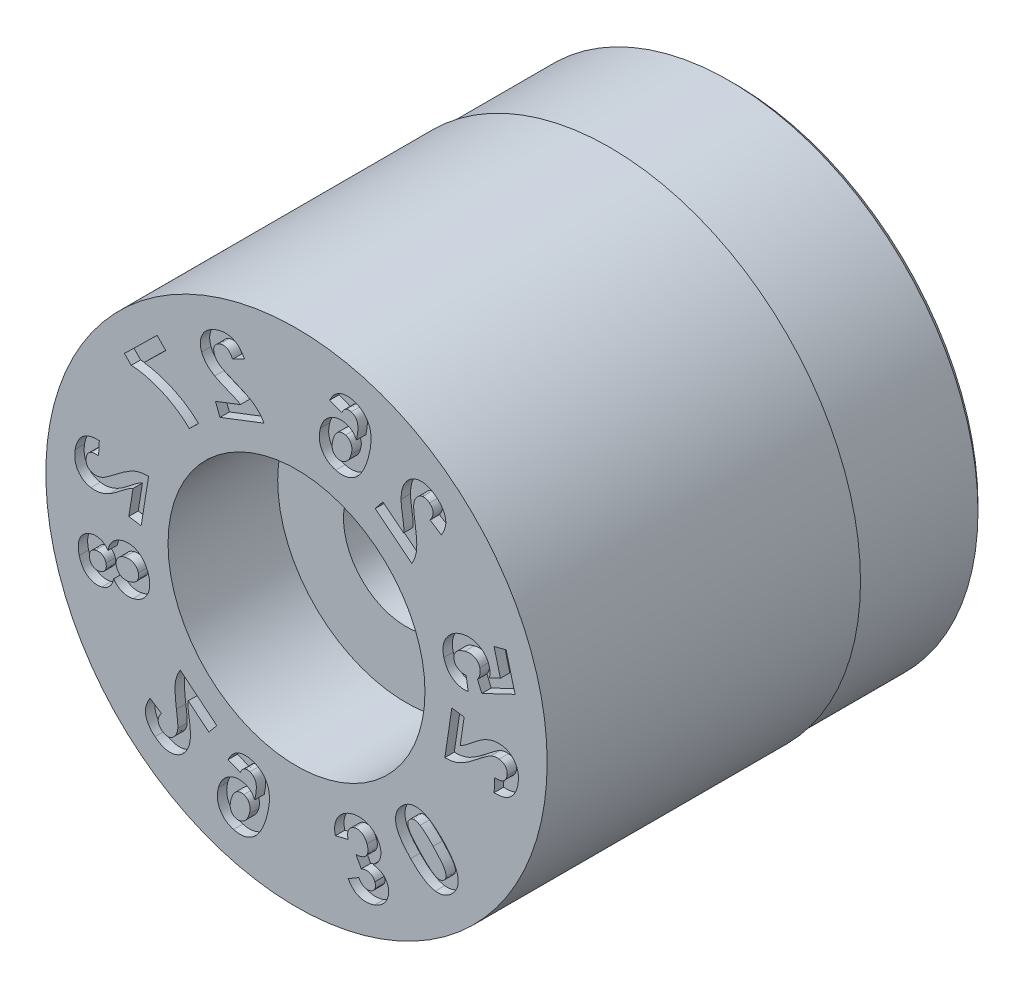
from build123d import *

# Parameters (mm, degrees)
SKETCH4_W          = 4
SKETCH4_H          = 1
CUT_EXTRUDE1_DEPTH = 0.3


with BuildPart() as part:
    # Sketch1 → Revolve1 (revolve)
    with BuildSketch(Plane(origin=(0, 0, 0), x_dir=(0, 0, -1), z_dir=(1, 0, 0)), mode=Mode.PRIVATE) as revolve1_sk:
        Polygon((0, 8), (0, 4.1), (3.5, 4.1), (3.5, 2), (14, 2), (14, 7.75), (13.75, 8), align=None)
    revolve(revolve1_sk.sketch.rotate(Axis((0, 0, 3.797909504), (0, 0, -1)), 90), axis=Axis((0, 0, 3.797909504), (0, 0, -1)))

    # Sketch4 → Cut-Revolve1 (revolve, cut)
    with BuildSketch(Plane(origin=(0, 0, 0), x_dir=(0, 0, -1), z_dir=(1, 0, 0)), mode=Mode.PRIVATE) as cut_revolve1_sk:
        with Locations((12, 8.435)):
            Rectangle(SKETCH4_W, SKETCH4_H)
    revolve(cut_revolve1_sk.sketch.rotate(Axis((0, 0, 0), (0, 0, -1)), 90), axis=Axis((0, 0, 0), (0, 0, -1)), mode=Mode.SUBTRACT)

    # Sketch6 → Cut-Extrude1 (cut)
    # profile 1 of 12: a face of its own
    with BuildSketch(Plane.XY):
        with BuildLine():
            Line((5.350875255, -0.073440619), (4.957338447, -0.014778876))
            Line((4.957338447, -0.014778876), (4.73514166, -1.498937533))
            add(Edge.make_bspline(
                [(4.73514166, -1.498937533), (4.772862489, -1.499467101), (4.848212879, -1.500524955), (4.960666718, -1.485157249), (5.071866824, -1.458538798), (5.163908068, -1.425753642), (5.239549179, -1.39124254), (5.301678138, -1.358306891), (5.369002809, -1.318716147), (5.441513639, -1.272567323), (5.519028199, -1.219199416), (5.601750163, -1.159157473), (5.690104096, -1.092947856), (5.749818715, -1.045458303), (5.780743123, -1.020864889)],
                knots=[0, 0, 0, 0, 1.151830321, 2.3008737, 3.457966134, 4.642906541, 5.280622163, 5.998342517, 6.791414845, 7.667669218, 8.625223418, 9.66778955, 10.79221822, 12, 12, 12, 12], degree=3))
            add(Edge.make_bspline(
                [(5.780743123, -1.020864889), (5.805344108, -1.001313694), (5.852300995, -0.963995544), (5.920174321, -0.911860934), (5.981414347, -0.865335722), (6.036546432, -0.825255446), (6.085164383, -0.791090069), (6.127043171, -0.762649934), (6.162974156, -0.7409212), (6.18511579, -0.729110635), (6.194959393, -0.72385996)],
                knots=[0, 0, 0, 0, 1.477890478, 2.820908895, 4.025130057, 5.094934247, 6.026396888, 6.819876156, 7.47534715, 8, 8, 8, 8], degree=3))
            add(Edge.make_bspline(
                [(6.194959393, -0.72385996), (6.218339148, -0.713728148), (6.263650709, -0.694092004), (6.33349756, -0.677106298), (6.401398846, -0.668848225), (6.445458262, -0.67308828), (6.467208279, -0.675181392)],
                knots=[0, 0, 0, 0, 1.088849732, 2.110265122, 3.067128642, 4, 4, 4, 4], degree=3))
            add(Edge.make_bspline(
                [(6.467208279, -0.675181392), (6.489516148, -0.679210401), (6.531782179, -0.686844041), (6.589048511, -0.710861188), (6.637316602, -0.742118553), (6.675036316, -0.782804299), (6.702412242, -0.830295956), (6.719114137, -0.884041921), (6.725476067, -0.943446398), (6.720707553, -0.984259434), (6.718218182, -1.00556561)],
                knots=[0, 0, 0, 0, 1.15195081, 2.182565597, 3.14163902, 4.060774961, 4.981567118, 5.911636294, 6.9097835, 8, 8, 8, 8], degree=3))
            add(Edge.make_bspline(
                [(6.718218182, -1.00556561), (6.714262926, -1.026486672), (6.706645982, -1.066775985), (6.682548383, -1.121688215), (6.649626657, -1.168403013), (6.614559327, -1.200001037), (6.581976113, -1.220025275), (6.554576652, -1.233203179), (6.52399607, -1.243497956), (6.490364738, -1.251164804), (6.453910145, -1.255749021), (6.414606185, -1.258630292), (6.372257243, -1.25815359), (6.343044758, -1.256215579), (6.327918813, -1.255212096)],
                knots=[0, 0, 0, 0, 1.461692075, 2.814893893, 4.090192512, 5.370595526, 6.030130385, 6.718074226, 7.458567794, 8.246087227, 9.088198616, 9.985036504, 10.956671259, 12, 12, 12, 12], degree=3))
            Line((6.327918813, -1.255212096), (6.307188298, -1.683450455))
            add(Edge.make_bspline(
                [(6.307188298, -1.683450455), (6.335860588, -1.684226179), (6.391548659, -1.685732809), (6.472520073, -1.679857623), (6.548307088, -1.669587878), (6.618510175, -1.652304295), (6.683217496, -1.628805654), (6.743021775, -1.600056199), (6.796967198, -1.564414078), (6.845293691, -1.522903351), (6.888364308, -1.4764953), (6.927888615, -1.426738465), (6.962746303, -1.373001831), (6.992991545, -1.315343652), (7.019462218, -1.253945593), (7.040998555, -1.188518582), (7.059133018, -1.119519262), (7.06707704, -1.071887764), (7.071134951, -1.047556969)],
                knots=[0, 0, 0, 0, 1.236958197, 2.402452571, 3.498689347, 4.53379571, 5.515319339, 6.464782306, 7.390305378, 8.296740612, 9.207131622, 10.1184916, 11.035712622, 11.966420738, 12.925046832, 13.91728129, 14.936119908, 16, 16, 16, 16], degree=3))
            add(Edge.make_bspline(
                [(7.071134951, -1.047556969), (7.074521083, -1.020858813), (7.08111326, -0.968882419), (7.084257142, -0.892229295), (7.081138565, -0.819177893), (7.071806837, -0.749505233), (7.056190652, -0.683330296), (7.034746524, -0.620621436), (7.006638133, -0.561701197), (6.972684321, -0.506834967), (6.934047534, -0.456217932), (6.891033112, -0.411190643), (6.845319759, -0.370665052), (6.795165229, -0.336605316), (6.741903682, -0.307436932), (6.684793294, -0.283937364), (6.624326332, -0.265678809), (6.582286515, -0.258379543), (6.560986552, -0.254681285)],
                knots=[0, 0, 0, 0, 1.218920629, 2.37301404, 3.471042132, 4.527914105, 5.552959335, 6.546883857, 7.5249478, 8.504053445, 9.465489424, 10.404370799, 11.321532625, 12.227895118, 13.145031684, 14.068236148, 15.021249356, 16, 16, 16, 16], degree=3))
            add(Edge.make_bspline(
                [(6.560986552, -0.254681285), (6.536343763, -0.251707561), (6.487286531, -0.245787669), (6.413394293, -0.244938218), (6.340400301, -0.251785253), (6.26751645, -0.264504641), (6.19412598, -0.285933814), (6.118278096, -0.313804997), (6.039969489, -0.349916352), (5.987899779, -0.378375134), (5.961047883, -0.393051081)],
                knots=[0, 0, 0, 0, 0.947880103, 1.886976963, 2.816481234, 3.745825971, 4.709119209, 5.733193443, 6.831027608, 8, 8, 8, 8], degree=3))
            add(Edge.make_bspline(
                [(5.961047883, -0.393051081), (5.951402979, -0.3986831), (5.93070964, -0.410766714), (5.89852655, -0.431716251), (5.862900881, -0.455960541), (5.824300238, -0.484129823), (5.781665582, -0.514474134), (5.736898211, -0.549852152), (5.687813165, -0.587285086), (5.637603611, -0.628134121), (5.587766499, -0.668161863), (5.541361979, -0.705681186), (5.499340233, -0.73888835), (5.461490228, -0.767683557), (5.429022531, -0.793465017), (5.400229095, -0.81401518), (5.376807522, -0.831754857), (5.34038271, -0.855358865), (5.291713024, -0.885370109), (5.246529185, -0.905099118), (5.225054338, -0.914475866)],
                knots=[0, 0, 0, 0, 0.666935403, 1.430923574, 2.29271232, 3.240244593, 4.284655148, 5.417406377, 6.647174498, 7.971140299, 9.282642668, 10.464744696, 11.535005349, 12.481049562, 13.305063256, 14.010310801, 14.593528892, 15.058807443, 16.602118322, 18, 18, 18, 18], degree=3))
            Line((5.225054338, -0.914475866), (5.350875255, -0.073440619))
        make_face()
    # profile 2 of 12: a face of its own
    with BuildSketch(Plane.XY):
        with BuildLine():
            Line((5.479063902, 0.695615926), (5.41328321, 1.116699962))
            add(Edge.make_bspline(
                [(5.41328321, 1.116699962), (5.390162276, 1.114322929), (5.345546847, 1.109736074), (5.280182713, 1.116989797), (5.219513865, 1.133194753), (5.164949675, 1.160536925), (5.117415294, 1.195543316), (5.078816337, 1.237678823), (5.048768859, 1.285813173), (5.037432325, 1.321727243), (5.031680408, 1.339949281)],
                knots=[0, 0, 0, 0, 1.147800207, 2.214858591, 3.235265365, 4.242079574, 5.217887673, 6.141732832, 7.057154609, 8, 8, 8, 8], degree=3))
            add(Edge.make_bspline(
                [(5.031680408, 1.339949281), (5.029198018, 1.350554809), (5.024275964, 1.371583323), (5.021429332, 1.40356684), (5.021778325, 1.435041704), (5.025578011, 1.466053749), (5.033560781, 1.496593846), (5.044895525, 1.526828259), (5.060047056, 1.556701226), (5.078263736, 1.586263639), (5.100775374, 1.614598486), (5.127428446, 1.64095), (5.158086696, 1.665578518), (5.192824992, 1.688159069), (5.231490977, 1.708880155), (5.274138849, 1.727770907), (5.320967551, 1.744219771), (5.353821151, 1.753697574), (5.370701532, 1.758567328)],
                knots=[0, 0, 0, 0, 0.863567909, 1.712272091, 2.540542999, 3.358536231, 4.18500272, 5.039966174, 5.91636349, 6.839457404, 7.791591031, 8.780927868, 9.808127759, 10.90747075, 12.064349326, 13.286433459, 14.605752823, 16, 16, 16, 16], degree=3))
            add(Edge.make_bspline(
                [(5.370701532, 1.758567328), (5.386801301, 1.762624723), (5.417984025, 1.770483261), (5.464089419, 1.777483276), (5.507669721, 1.782381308), (5.54897773, 1.782043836), (5.588115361, 1.779695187), (5.624735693, 1.772790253), (5.658898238, 1.762372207), (5.690545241, 1.748579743), (5.719926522, 1.731915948), (5.746348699, 1.712076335), (5.770963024, 1.690671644), (5.791883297, 1.665843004), (5.810861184, 1.63914088), (5.826852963, 1.609642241), (5.840368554, 1.577695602), (5.846860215, 1.555099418), (5.850174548, 1.54356288)],
                knots=[0, 0, 0, 0, 1.339227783, 2.593873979, 3.761088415, 4.874133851, 5.923460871, 6.921801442, 7.873927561, 8.800379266, 9.70295327, 10.593141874, 11.463620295, 12.329270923, 13.206480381, 14.103907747, 15.0319453, 16, 16, 16, 16], degree=3))
            add(Edge.make_bspline(
                [(5.850174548, 1.54356288), (5.853590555, 1.528779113), (5.860355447, 1.499502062), (5.864003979, 1.45459034), (5.862863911, 1.409675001), (5.856767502, 1.36445155), (5.844719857, 1.319283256), (5.827340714, 1.274185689), (5.805234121, 1.228809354), (5.787061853, 1.199601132), (5.77774409, 1.184624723)],
                knots=[0, 0, 0, 0, 0.962922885, 1.906925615, 2.853097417, 3.813367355, 4.798875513, 5.815688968, 6.880002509, 8, 8, 8, 8], degree=3))
            Line((5.77774409, 1.184624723), (5.914506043, 0.863250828))
            Line((5.914506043, 0.863250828), (6.975644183, 1.369333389))
            Line((6.975644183, 1.369333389), (6.688380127, 2.457428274))
            Line((6.688380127, 2.457428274), (6.303255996, 2.355545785))
            Line((6.303255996, 2.355545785), (6.508115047, 1.579702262))
            Line((6.508115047, 1.579702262), (6.160921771, 1.419011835))
            add(Edge.make_bspline(
                [(6.160921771, 1.419011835), (6.165459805, 1.444638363), (6.174378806, 1.495004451), (6.177171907, 1.571080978), (6.17127804, 1.645652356), (6.160336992, 1.693946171), (6.154882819, 1.718020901)],
                knots=[0, 0, 0, 0, 1.034135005, 2.032477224, 3.019179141, 4, 4, 4, 4], degree=3))
            add(Edge.make_bspline(
                [(6.154882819, 1.718020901), (6.148336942, 1.740286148), (6.135473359, 1.784040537), (6.10879852, 1.846377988), (6.077193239, 1.904685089), (6.03927854, 1.95838093), (5.996251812, 2.008066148), (5.947132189, 2.053061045), (5.892664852, 2.093975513), (5.83346411, 2.13057663), (5.770247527, 2.161172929), (5.704455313, 2.185601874), (5.636473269, 2.202615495), (5.566341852, 2.213178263), (5.494062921, 2.216234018), (5.419663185, 2.211863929), (5.343170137, 2.201564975), (5.292181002, 2.189344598), (5.26619315, 2.183116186)],
                knots=[0, 0, 0, 0, 0.99245842, 1.950322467, 2.895587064, 3.825840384, 4.757714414, 5.70324139, 6.670789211, 7.669393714, 8.677085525, 9.671603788, 10.66755518, 11.670785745, 12.701978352, 13.757284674, 14.856945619, 16, 16, 16, 16], degree=3))
            add(Edge.make_bspline(
                [(5.26619315, 2.183116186), (5.244536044, 2.177004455), (5.201537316, 2.164870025), (5.139836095, 2.14027101), (5.08060434, 2.112537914), (5.025138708, 2.07920624), (4.97247646, 2.04224416), (4.922577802, 2.001100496), (4.87617332, 1.95519688), (4.847967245, 1.921672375), (4.833797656, 1.904831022)],
                knots=[0, 0, 0, 0, 1.031430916, 2.047836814, 3.042497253, 4.028093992, 5.011327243, 5.991295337, 6.990908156, 8, 8, 8, 8], degree=3))
            add(Edge.make_bspline(
                [(4.833797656, 1.904831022), (4.815775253, 1.881080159), (4.780365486, 1.83441532), (4.738706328, 1.758234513), (4.706707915, 1.679863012), (4.685228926, 1.598573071), (4.67396594, 1.514601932), (4.673082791, 1.427831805), (4.682503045, 1.338369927), (4.696291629, 1.278877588), (4.703345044, 1.248444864)],
                knots=[0, 0, 0, 0, 1.026639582, 2.017104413, 2.982926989, 3.93888037, 4.907448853, 5.896178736, 6.923810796, 8, 8, 8, 8], degree=3))
            add(Edge.make_bspline(
                [(4.703345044, 1.248444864), (4.710144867, 1.224253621), (4.723440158, 1.176953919), (4.750061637, 1.109803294), (4.779247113, 1.046889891), (4.813799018, 0.989338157), (4.851320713, 0.935745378), (4.893978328, 0.887705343), (4.939938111, 0.843612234), (4.99033645, 0.805236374), (5.043540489, 0.771392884), (5.099386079, 0.743401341), (5.157362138, 0.720814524), (5.217690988, 0.704667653), (5.280053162, 0.693704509), (5.344610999, 0.68806525), (5.411364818, 0.688372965), (5.456254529, 0.693175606), (5.479063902, 0.695615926)],
                knots=[0, 0, 0, 0, 1.146450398, 2.241586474, 3.293714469, 4.30904754, 5.302080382, 6.276002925, 7.237161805, 8.205343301, 9.162775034, 10.112039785, 11.052616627, 11.998380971, 12.958266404, 13.939959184, 14.953251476, 16, 16, 16, 16], degree=3))
        make_face()
    # profile 3 of 12: a face of its own
    with BuildSketch(Plane.XY):
        with BuildLine():
            Line((2.758569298, 4.580784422), (2.511498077, 4.271740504))
            Line((2.511498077, 4.271740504), (3.677502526, 3.338846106))
            add(Edge.make_bspline(
                [(3.677502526, 3.338846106), (3.696756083, 3.371019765), (3.735236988, 3.435323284), (3.777603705, 3.539863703), (3.810996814, 3.648494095), (3.828181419, 3.744060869), (3.835947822, 3.826301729), (3.839174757, 3.896184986), (3.838557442, 3.973974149), (3.834905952, 4.059454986), (3.828397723, 4.152849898), (3.817676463, 4.253890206), (3.805168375, 4.362972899), (3.794130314, 4.438062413), (3.788408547, 4.476986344)],
                knots=[0, 0, 0, 0, 1.151035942, 2.300504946, 3.456524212, 4.640284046, 5.277057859, 5.995234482, 6.789724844, 7.667529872, 8.625071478, 9.667087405, 10.790694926, 12, 12, 12, 12], degree=3))
            add(Edge.make_bspline(
                [(3.788408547, 4.476986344), (3.783806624, 4.507989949), (3.775040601, 4.567047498), (3.764158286, 4.651572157), (3.754609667, 4.727558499), (3.748066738, 4.795006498), (3.742312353, 4.853731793), (3.739592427, 4.903884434), (3.737861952, 4.945616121), (3.7392339, 4.970570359), (3.73984039, 4.981601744)],
                knots=[0, 0, 0, 0, 1.48196541, 2.822937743, 4.029546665, 5.102768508, 6.027087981, 6.818904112, 7.477879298, 8, 8, 8, 8], degree=3))
            add(Edge.make_bspline(
                [(3.73984039, 4.981601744), (3.742650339, 5.006894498), (3.748079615, 5.055764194), (3.768822, 5.124313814), (3.795300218, 5.187053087), (3.821389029, 5.222670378), (3.834242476, 5.240218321)],
                knots=[0, 0, 0, 0, 1.09132187, 2.108610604, 3.068149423, 4, 4, 4, 4], degree=3))
            add(Edge.make_bspline(
                [(3.834242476, 5.240218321), (3.848894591, 5.257316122), (3.876612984, 5.289661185), (3.925535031, 5.327099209), (3.976418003, 5.352940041), (4.030108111, 5.364637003), (4.084564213, 5.364808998), (4.138968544, 5.352126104), (4.193243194, 5.327919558), (4.226017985, 5.303636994), (4.243229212, 5.290885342)],
                knots=[0, 0, 0, 0, 1.152718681, 2.180675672, 3.139986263, 4.057457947, 4.973989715, 5.912059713, 6.903547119, 8, 8, 8, 8], degree=3))
            add(Edge.make_bspline(
                [(4.243229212, 5.290885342), (4.259240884, 5.276895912), (4.289877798, 5.250128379), (4.325233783, 5.202075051), (4.34944416, 5.15065421), (4.359011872, 5.104565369), (4.360001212, 5.066482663), (4.357666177, 5.036369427), (4.350831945, 5.005175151), (4.340951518, 4.972509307), (4.326791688, 4.938741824), (4.308891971, 4.903559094), (4.287772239, 4.867045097), (4.271356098, 4.842980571), (4.262910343, 4.830599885)],
                knots=[0, 0, 0, 0, 1.467346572, 2.807637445, 4.094007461, 5.372627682, 6.029009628, 6.725944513, 7.456260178, 8.233652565, 9.084303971, 9.985282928, 10.963471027, 12, 12, 12, 12], degree=3))
            Line((4.262910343, 4.830599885), (4.621201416, 4.598737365))
            add(Edge.make_bspline(
                [(4.621201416, 4.598737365), (4.63609778, 4.623028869), (4.665069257, 4.670272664), (4.70100822, 4.742643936), (4.729424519, 4.813311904), (4.749845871, 4.882331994), (4.76232018, 4.949653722), (4.766824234, 5.015286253), (4.763191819, 5.07934719), (4.751831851, 5.141613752), (4.733891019, 5.202079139), (4.710541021, 5.26086617), (4.681476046, 5.317665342), (4.64716425, 5.372850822), (4.607502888, 5.426296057), (4.561994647, 5.477514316), (4.511406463, 5.527207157), (4.47445345, 5.557932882), (4.455547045, 5.573653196)],
                knots=[0, 0, 0, 0, 1.235346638, 2.40258753, 3.499625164, 4.535020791, 5.51894604, 6.463237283, 7.381265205, 8.294331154, 9.201940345, 10.112491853, 11.033843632, 11.965278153, 12.927893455, 13.91646801, 14.933994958, 16, 16, 16, 16], degree=3))
            add(Edge.make_bspline(
                [(4.455547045, 5.573653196), (4.434348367, 5.589972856), (4.393106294, 5.621722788), (4.328565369, 5.662495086), (4.264136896, 5.696248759), (4.199623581, 5.723276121), (4.135049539, 5.743199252), (4.070270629, 5.755644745), (4.005575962, 5.761263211), (3.941369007, 5.759007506), (3.878662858, 5.751035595), (3.818300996, 5.737150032), (3.76104251, 5.717226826), (3.706349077, 5.692085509), (3.654739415, 5.660525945), (3.606237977, 5.622990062), (3.560075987, 5.580311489), (3.532906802, 5.547776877), (3.51904522, 5.531177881)],
                knots=[0, 0, 0, 0, 1.218367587, 2.370336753, 3.472905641, 4.528847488, 5.552777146, 6.545975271, 7.52885904, 8.504830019, 9.46726466, 10.405066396, 11.321234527, 12.22481178, 13.142615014, 14.070572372, 15.015615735, 16, 16, 16, 16], degree=3))
            add(Edge.make_bspline(
                [(3.51904522, 5.531177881), (3.504075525, 5.511383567), (3.474482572, 5.47225303), (3.436840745, 5.409097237), (3.406205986, 5.342966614), (3.380710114, 5.273693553), (3.362325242, 5.199776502), (3.348410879, 5.120516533), (3.340705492, 5.035025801), (3.339056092, 4.975975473), (3.338205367, 4.945518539)],
                knots=[0, 0, 0, 0, 0.951846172, 1.881664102, 2.81460478, 3.745405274, 4.709741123, 5.733318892, 6.830892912, 8, 8, 8, 8], degree=3))
            add(Edge.make_bspline(
                [(3.338205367, 4.945518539), (3.338174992, 4.934289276), (3.338110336, 4.910386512), (3.339881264, 4.872236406), (3.343015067, 4.82965138), (3.347753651, 4.782473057), (3.35325988, 4.730764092), (3.360378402, 4.674454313), (3.369103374, 4.613714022), (3.378373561, 4.550051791), (3.388014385, 4.487225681), (3.39731928, 4.428600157), (3.404326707, 4.375856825), (3.410573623, 4.329074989), (3.416437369, 4.288281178), (3.419859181, 4.25323324), (3.422947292, 4.224148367), (3.425615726, 4.181119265), (3.426733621, 4.124235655), (3.421505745, 4.075479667), (3.419016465, 4.052264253)],
                knots=[0, 0, 0, 0, 0.674395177, 1.435526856, 2.29314672, 3.238954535, 4.283333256, 5.416529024, 6.647811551, 7.969061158, 9.280660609, 10.465601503, 11.534259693, 12.476271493, 13.300629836, 14.00917805, 14.591213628, 15.057069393, 16.598708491, 18, 18, 18, 18], degree=3))
            Line((3.419016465, 4.052264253), (2.758569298, 4.580784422))
        make_face()
    # profile 4 of 12: a face of its own
    with BuildSketch(Plane.XY):
        with BuildLine():
            Line((1.05959506, 6.541161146), (1.445888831, 6.3871951))
            add(Edge.make_bspline(
                [(1.445888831, 6.3871951), (1.453953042, 6.405787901), (1.469154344, 6.440835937), (1.499567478, 6.486094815), (1.532726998, 6.522708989), (1.570827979, 6.548706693), (1.611894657, 6.565308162), (1.655407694, 6.573705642), (1.701495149, 6.572781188), (1.732019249, 6.565894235), (1.747811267, 6.562331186)],
                knots=[0, 0, 0, 0, 1.249261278, 2.354898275, 3.352323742, 4.282337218, 5.176861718, 6.070760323, 7.001884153, 8, 8, 8, 8], degree=3))
            add(Edge.make_bspline(
                [(1.747811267, 6.562331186), (1.758452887, 6.559165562), (1.779518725, 6.552898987), (1.808712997, 6.538077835), (1.836022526, 6.521000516), (1.860985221, 6.500305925), (1.883007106, 6.475797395), (1.903293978, 6.448368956), (1.921115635, 6.417597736), (1.937104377, 6.383066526), (1.949442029, 6.342977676), (1.957242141, 6.296199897), (1.960462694, 6.242250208), (1.960183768, 6.181028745), (1.954546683, 6.112469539), (1.945308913, 6.03651227), (1.932382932, 5.9531567), (1.920609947, 5.895509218), (1.914475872, 5.865473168)],
                knots=[0, 0, 0, 0, 0.67003816, 1.326387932, 1.971641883, 2.615359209, 3.27927252, 3.959214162, 4.674815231, 5.425756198, 6.255632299, 7.202555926, 8.286163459, 9.520115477, 10.901434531, 12.442747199, 14.146565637, 16, 16, 16, 16], degree=3))
            add(Edge.make_bspline(
                [(1.914475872, 5.865473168), (1.905526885, 5.883487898), (1.888021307, 5.918727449), (1.855886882, 5.967389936), (1.820439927, 6.011464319), (1.780471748, 6.050007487), (1.736781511, 6.08361377), (1.689062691, 6.111927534), (1.637443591, 6.135581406), (1.600940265, 6.146754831), (1.58238047, 6.152435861)],
                knots=[0, 0, 0, 0, 1.062555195, 2.078519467, 3.076060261, 4.047065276, 5.006665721, 5.983629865, 6.974794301, 8, 8, 8, 8], degree=3))
            add(Edge.make_bspline(
                [(1.58238047, 6.152435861), (1.561083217, 6.157852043), (1.519168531, 6.168511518), (1.455158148, 6.175427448), (1.391977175, 6.176534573), (1.329314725, 6.170588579), (1.267382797, 6.157932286), (1.206043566, 6.138312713), (1.14519244, 6.112189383), (1.085982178, 6.078854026), (1.028714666, 6.040761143), (0.976488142, 5.995821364), (0.928440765, 5.946553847), (0.885185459, 5.891991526), (0.847590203, 5.831786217), (0.814063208, 5.76680906), (0.785195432, 5.696685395), (0.770472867, 5.647350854), (0.762966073, 5.622195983)],
                knots=[0, 0, 0, 0, 0.967024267, 1.903180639, 2.828416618, 3.747166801, 4.670127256, 5.607849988, 6.579641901, 7.582056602, 8.597691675, 9.604467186, 10.611068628, 11.62579748, 12.665285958, 13.732965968, 14.844076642, 16, 16, 16, 16], degree=3))
            add(Edge.make_bspline(
                [(0.762966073, 5.622195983), (0.756236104, 5.595267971), (0.743064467, 5.542565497), (0.730462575, 5.463580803), (0.725889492, 5.386937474), (0.727731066, 5.312546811), (0.737496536, 5.24062949), (0.753803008, 5.170813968), (0.778179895, 5.103805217), (0.809185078, 5.039776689), (0.84593447, 4.979332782), (0.888633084, 4.92397334), (0.936316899, 4.873642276), (0.989454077, 4.829047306), (1.04712359, 4.788950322), (1.110732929, 4.755403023), (1.178752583, 4.725660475), (1.227083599, 4.711446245), (1.251684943, 4.704210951)],
                knots=[0, 0, 0, 0, 1.138544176, 2.228315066, 3.276004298, 4.284946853, 5.276565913, 6.248698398, 7.221124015, 8.195677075, 9.163519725, 10.11821804, 11.058982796, 12.002490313, 12.959970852, 13.934913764, 14.948834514, 16, 16, 16, 16], degree=3))
            add(Edge.make_bspline(
                [(1.251684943, 4.704210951), (1.278399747, 4.697508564), (1.330907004, 4.684335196), (1.410666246, 4.676088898), (1.488904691, 4.674448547), (1.565630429, 4.684247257), (1.641139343, 4.701217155), (1.714988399, 4.728067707), (1.787249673, 4.76368486), (1.858232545, 4.807774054), (1.926547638, 4.862895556), (1.991146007, 4.929903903), (2.051111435, 5.00947601), (2.107660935, 5.100394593), (2.160757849, 5.202947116), (2.209643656, 5.317478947), (2.255154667, 5.443717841), (2.280816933, 5.532841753), (2.294108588, 5.579003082)],
                knots=[0, 0, 0, 0, 0.858707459, 1.687767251, 2.49695679, 3.296177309, 4.095562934, 4.908630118, 5.74245162, 6.606610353, 7.511767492, 8.475293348, 9.504386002, 10.616132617, 11.814116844, 13.105535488, 14.500825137, 16, 16, 16, 16], degree=3))
            add(Edge.make_bspline(
                [(2.294108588, 5.579003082), (2.3067565, 5.626609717), (2.331183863, 5.718554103), (2.356933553, 5.853868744), (2.374264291, 5.980601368), (2.381586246, 6.099079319), (2.379210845, 6.209074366), (2.367242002, 6.310868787), (2.3452832, 6.404297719), (2.313603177, 6.489579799), (2.273267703, 6.566549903), (2.227436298, 6.637016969), (2.174733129, 6.700379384), (2.115281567, 6.756158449), (2.049990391, 6.805467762), (1.977920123, 6.846892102), (1.900054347, 6.882373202), (1.844632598, 6.899162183), (1.816454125, 6.907698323)],
                knots=[0, 0, 0, 0, 1.478732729, 2.855929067, 4.133127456, 5.317605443, 6.416565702, 7.432689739, 8.38981265, 9.291676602, 10.156783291, 10.994153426, 11.811734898, 12.625023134, 13.437121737, 14.26277914, 15.116732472, 16, 16, 16, 16], degree=3))
            add(Edge.make_bspline(
                [(1.816454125, 6.907698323), (1.796349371, 6.912956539), (1.756932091, 6.923265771), (1.697602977, 6.931947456), (1.639957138, 6.93652446), (1.58369685, 6.93581716), (1.528750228, 6.930398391), (1.475411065, 6.919309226), (1.42326328, 6.904213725), (1.37307919, 6.882995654), (1.32457687, 6.857535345), (1.278860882, 6.826623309), (1.235511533, 6.791202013), (1.194678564, 6.750929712), (1.156630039, 6.705630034), (1.121594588, 6.655249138), (1.088653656, 6.600343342), (1.069421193, 6.561173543), (1.05959506, 6.541161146)],
                knots=[0, 0, 0, 0, 1.075714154, 2.109039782, 3.100974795, 4.068677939, 5.019713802, 5.956278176, 6.887101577, 7.827248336, 8.773559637, 9.720478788, 10.680610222, 11.669732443, 12.686900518, 13.740426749, 14.84555252, 16, 16, 16, 16], degree=3))
        make_face()
        with BuildLine():
            add(Edge.make_bspline(
                [(1.744253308, 5.385998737), (1.739613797, 5.36976687), (1.730572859, 5.338136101), (1.71285976, 5.29348232), (1.694433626, 5.251956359), (1.672999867, 5.214487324), (1.649719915, 5.180611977), (1.624482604, 5.15018006), (1.596483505, 5.124139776), (1.567283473, 5.101308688), (1.537000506, 5.082085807), (1.506295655, 5.06693594), (1.475957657, 5.054725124), (1.445639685, 5.046446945), (1.415463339, 5.041555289), (1.385329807, 5.041255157), (1.355226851, 5.043565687), (1.335565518, 5.048239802), (1.325659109, 5.050594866)],
                knots=[0, 0, 0, 0, 1.356641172, 2.643663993, 3.859063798, 5.007025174, 6.108794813, 7.161448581, 8.178705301, 9.17706262, 10.138784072, 11.057029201, 11.926954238, 12.764307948, 13.579493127, 14.377304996, 15.182401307, 16, 16, 16, 16], degree=3))
            add(Edge.make_bspline(
                [(1.325659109, 5.050594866), (1.307526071, 5.056674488), (1.272053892, 5.068567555), (1.225717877, 5.100729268), (1.18718717, 5.141870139), (1.162573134, 5.183849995), (1.148280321, 5.222116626), (1.140109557, 5.254257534), (1.135756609, 5.289409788), (1.134929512, 5.327314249), (1.137261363, 5.368087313), (1.142845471, 5.411762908), (1.151823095, 5.458333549), (1.16001117, 5.490093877), (1.164247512, 5.506526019)],
                knots=[0, 0, 0, 0, 1.257363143, 2.459676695, 3.677845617, 4.956434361, 5.641194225, 6.37069404, 7.140684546, 7.974545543, 8.870855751, 9.834770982, 10.879754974, 12, 12, 12, 12], degree=3))
            add(Edge.make_bspline(
                [(1.164247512, 5.506526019), (1.169117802, 5.523332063), (1.178541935, 5.555852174), (1.195811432, 5.601890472), (1.213613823, 5.644127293), (1.234214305, 5.681719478), (1.255588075, 5.71551206), (1.278839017, 5.744948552), (1.303830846, 5.77004539), (1.33050929, 5.790770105), (1.357978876, 5.808053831), (1.386248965, 5.821270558), (1.414553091, 5.831951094), (1.443485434, 5.839047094), (1.473036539, 5.84194338), (1.502890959, 5.841953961), (1.533331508, 5.838814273), (1.553299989, 5.833934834), (1.563463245, 5.83145137)],
                knots=[0, 0, 0, 0, 1.447808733, 2.801545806, 4.06798065, 5.23805693, 6.345522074, 7.374438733, 8.336630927, 9.269689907, 10.165194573, 11.01715368, 11.848438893, 12.666313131, 13.47467688, 14.300080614, 15.134800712, 16, 16, 16, 16], degree=3))
            add(Edge.make_bspline(
                [(1.563463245, 5.83145137), (1.582328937, 5.825140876), (1.619394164, 5.812742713), (1.667939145, 5.779217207), (1.708763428, 5.736062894), (1.735024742, 5.69214772), (1.751532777, 5.653063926), (1.760545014, 5.620802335), (1.766238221, 5.586632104), (1.768088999, 5.550358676), (1.767664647, 5.512093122), (1.763280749, 5.471776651), (1.755289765, 5.429394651), (1.748013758, 5.400785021), (1.744253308, 5.385998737)],
                knots=[0, 0, 0, 0, 1.320572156, 2.594514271, 3.88500356, 5.256003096, 5.979157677, 6.708940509, 7.483534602, 8.283611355, 9.127144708, 10.032345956, 10.983059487, 12, 12, 12, 12], degree=3))
        make_face(mode=Mode.SUBTRACT)
    # profile 5 of 12: a face of its own
    with BuildSketch(Plane.XY):
        with BuildLine():
            Line((-2.585469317, 4.686836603), (-2.442055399, 4.315126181))
            Line((-2.442055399, 4.315126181), (-1.039988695, 4.856694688))
            add(Edge.make_bspline(
                [(-1.039988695, 4.856694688), (-1.058235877, 4.889646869), (-1.094708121, 4.955511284), (-1.163317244, 5.046071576), (-1.241890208, 5.129321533), (-1.315695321, 5.193639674), (-1.383504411, 5.241752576), (-1.442744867, 5.280098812), (-1.510862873, 5.318978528), (-1.587216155, 5.359207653), (-1.67199075, 5.40040237), (-1.764986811, 5.44296704), (-1.866493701, 5.486637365), (-1.937260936, 5.515333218), (-1.973943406, 5.530207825)],
                knots=[0, 0, 0, 0, 1.148640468, 2.295888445, 3.456333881, 4.638969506, 5.276710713, 5.993107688, 6.792272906, 7.66995805, 8.627193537, 9.668990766, 10.791712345, 12, 12, 12, 12], degree=3))
            add(Edge.make_bspline(
                [(-1.973943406, 5.530207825), (-2.003182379, 5.541966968), (-2.058921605, 5.564383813), (-2.138308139, 5.596864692), (-2.208840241, 5.627908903), (-2.271248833, 5.655326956), (-2.324976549, 5.68058098), (-2.37022922, 5.703359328), (-2.407191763, 5.723517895), (-2.428439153, 5.737064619), (-2.437785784, 5.743023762)],
                knots=[0, 0, 0, 0, 1.480311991, 2.821967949, 4.028603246, 5.099819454, 6.023741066, 6.816667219, 7.479457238, 8, 8, 8, 8], degree=3))
            add(Edge.make_bspline(
                [(-2.437785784, 5.743023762), (-2.458270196, 5.758393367), (-2.49790207, 5.788129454), (-2.547470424, 5.840492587), (-2.588061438, 5.895653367), (-2.60595995, 5.936168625), (-2.614782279, 5.956138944)],
                knots=[0, 0, 0, 0, 1.092112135, 2.11294574, 3.069854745, 4, 4, 4, 4], degree=3))
            add(Edge.make_bspline(
                [(-2.614782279, 5.956138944), (-2.622232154, 5.977510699), (-2.636406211, 6.018172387), (-2.644260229, 6.079911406), (-2.640495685, 6.137527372), (-2.623934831, 6.190372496), (-2.59643638, 6.237955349), (-2.55766519, 6.278708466), (-2.50915313, 6.313842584), (-2.471277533, 6.329938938), (-2.45140906, 6.338382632)],
                knots=[0, 0, 0, 0, 1.148615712, 2.185344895, 3.142161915, 4.063533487, 4.977107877, 5.91253788, 6.904976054, 8, 8, 8, 8], degree=3))
            add(Edge.make_bspline(
                [(-2.45140906, 6.338382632), (-2.431117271, 6.345246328), (-2.392248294, 6.358393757), (-2.332519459, 6.364660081), (-2.275583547, 6.359348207), (-2.230679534, 6.344638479), (-2.196816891, 6.326474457), (-2.172277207, 6.308385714), (-2.147901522, 6.287354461), (-2.124977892, 6.261650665), (-2.102640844, 6.23246803), (-2.08119428, 6.199270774), (-2.060474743, 6.162368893), (-2.047868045, 6.136023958), (-2.041319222, 6.122338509)],
                knots=[0, 0, 0, 0, 1.469211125, 2.814277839, 4.094261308, 5.375578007, 6.032255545, 6.729217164, 7.467300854, 8.242064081, 9.092219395, 9.992309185, 10.957061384, 12, 12, 12, 12], degree=3))
            Line((-2.041319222, 6.122338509), (-1.65800813, 6.315939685))
            add(Edge.make_bspline(
                [(-1.65800813, 6.315939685), (-1.671678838, 6.34116632), (-1.698182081, 6.390072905), (-1.742864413, 6.457839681), (-1.789614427, 6.518408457), (-1.839158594, 6.571154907), (-1.891527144, 6.615815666), (-1.946201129, 6.653278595), (-2.003639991, 6.682960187), (-2.063693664, 6.704487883), (-2.125219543, 6.719765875), (-2.188155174, 6.72907084), (-2.252354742, 6.732520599), (-2.317699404, 6.731065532), (-2.384212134, 6.722757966), (-2.451997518, 6.710185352), (-2.520941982, 6.691354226), (-2.566407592, 6.674639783), (-2.589541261, 6.666135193)],
                knots=[0, 0, 0, 0, 1.236344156, 2.396886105, 3.49459761, 4.530972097, 5.510164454, 6.455778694, 7.38203411, 8.288725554, 9.199386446, 10.110714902, 11.026634, 11.967913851, 12.924025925, 13.912575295, 14.937883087, 16, 16, 16, 16], degree=3))
            add(Edge.make_bspline(
                [(-2.589541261, 6.666135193), (-2.614480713, 6.656025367), (-2.663041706, 6.636339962), (-2.730955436, 6.600275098), (-2.793449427, 6.561850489), (-2.849130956, 6.518707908), (-2.899409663, 6.472996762), (-2.942774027, 6.422799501), (-2.98034898, 6.369261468), (-3.011067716, 6.312248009), (-3.036362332, 6.253836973), (-3.05435416, 6.194138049), (-3.06672895, 6.134173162), (-3.072082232, 6.073628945), (-3.070702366, 6.012807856), (-3.06273831, 5.951680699), (-3.049071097, 5.889917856), (-3.034554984, 5.849699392), (-3.027194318, 5.829305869)],
                knots=[0, 0, 0, 0, 1.21674073, 2.369183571, 3.474475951, 4.531760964, 5.551382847, 6.543746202, 7.526542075, 8.504625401, 9.468840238, 10.401437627, 11.320485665, 12.234517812, 13.14508075, 14.067240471, 15.019958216, 16, 16, 16, 16], degree=3))
            add(Edge.make_bspline(
                [(-3.027194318, 5.829305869), (-3.017663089, 5.806285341), (-2.998797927, 5.76072081), (-2.96245513, 5.696430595), (-2.921119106, 5.635969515), (-2.873114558, 5.57941469), (-2.818409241, 5.525902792), (-2.756743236, 5.473597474), (-2.686734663, 5.42312611), (-2.636159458, 5.391970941), (-2.610024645, 5.37587146)],
                knots=[0, 0, 0, 0, 0.950545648, 1.881414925, 2.81355593, 3.743487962, 4.708583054, 5.73246004, 6.828245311, 8, 8, 8, 8], degree=3))
            add(Edge.make_bspline(
                [(-2.610024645, 5.37587146), (-2.600232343, 5.370117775), (-2.579415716, 5.357886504), (-2.545218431, 5.340151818), (-2.506530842, 5.321126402), (-2.463241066, 5.300964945), (-2.415236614, 5.279937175), (-2.362663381, 5.257714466), (-2.305370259, 5.23428646), (-2.245087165, 5.210579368), (-2.185571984, 5.186949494), (-2.130153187, 5.164838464), (-2.080200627, 5.145147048), (-2.036360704, 5.126813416), (-1.998176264, 5.110605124), (-1.965658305, 5.096327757), (-1.938731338, 5.084129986), (-1.899699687, 5.065006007), (-1.849732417, 5.037175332), (-1.81020738, 5.007696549), (-1.791341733, 4.993626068)],
                knots=[0, 0, 0, 0, 0.677018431, 1.439216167, 2.295827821, 3.24735054, 4.285951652, 5.420150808, 6.650149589, 7.976105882, 9.282034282, 10.467795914, 11.533392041, 12.483057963, 13.300711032, 14.006450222, 14.600395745, 15.062794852, 16.598046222, 18, 18, 18, 18], degree=3))
            Line((-1.791341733, 4.993626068), (-2.585469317, 4.686836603))
        make_face()
    # profile 6 of 12: a face of its own
    with BuildSketch(Plane.XY):
        with BuildLine():
            Line((-4.171708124, 5.297493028), (-4.44909277, 5.580358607))
            Line((-4.44909277, 5.580358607), (-5.490867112, 4.558716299))
            Line((-5.490867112, 4.558716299), (-5.274437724, 4.337944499))
            add(Edge.make_bspline(
                [(-5.274437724, 4.337944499), (-5.252650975, 4.337568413), (-5.207994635, 4.336797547), (-5.139226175, 4.331422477), (-5.06700785, 4.32344011), (-4.99128569, 4.311006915), (-4.911937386, 4.29669706), (-4.829054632, 4.278093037), (-4.742884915, 4.255882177), (-4.623053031, 4.223085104), (-4.472839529, 4.174043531), (-4.295960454, 4.103014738), (-4.123121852, 4.021053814), (-3.98384227, 3.943192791), (-3.876150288, 3.876851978), (-3.799099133, 3.826658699), (-3.726083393, 3.775916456), (-3.65680851, 3.725046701), (-3.591334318, 3.673752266), (-3.53042849, 3.621495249), (-3.472938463, 3.569431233), (-3.436993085, 3.533607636), (-3.419299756, 3.515974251)],
                knots=[0, 0, 0, 0, 0.630735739, 1.29282018, 1.996170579, 2.733753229, 3.513932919, 4.330317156, 5.192345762, 6.090144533, 7.927104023, 9.763450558, 11.605177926, 13.461522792, 14.379866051, 15.266979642, 16.123536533, 16.953835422, 17.755072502, 18.530911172, 19.276873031, 20, 20, 20, 20], degree=3))
            Line((-3.419299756, 3.515974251), (-3.125850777, 3.803964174))
            add(Edge.make_bspline(
                [(-3.125850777, 3.803964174), (-3.153939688, 3.83048879), (-3.210369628, 3.883776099), (-3.299599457, 3.959401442), (-3.393025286, 4.031650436), (-3.490324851, 4.100873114), (-3.591899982, 4.166522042), (-3.697702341, 4.228590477), (-3.807504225, 4.287611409), (-3.920712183, 4.343355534), (-4.036533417, 4.39472129), (-4.153657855, 4.440979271), (-4.270785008, 4.48338716), (-4.388684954, 4.519918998), (-4.506776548, 4.55215606), (-4.625490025, 4.579339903), (-4.744568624, 4.601892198), (-4.824475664, 4.612744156), (-4.864385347, 4.618164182)],
                knots=[0, 0, 0, 0, 0.950068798, 1.908665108, 2.875339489, 3.85412804, 4.844724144, 5.848962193, 6.870282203, 7.910111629, 8.951876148, 9.985528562, 11.006821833, 12.014873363, 13.020429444, 14.016907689, 15.009541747, 16, 16, 16, 16], degree=3))
            Line((-4.864385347, 4.618164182), (-4.171708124, 5.297493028))
        make_face()
    # profile 7 of 12: a face of its own
    with BuildSketch(Plane.XY):
        with BuildLine():
            Line((-5.351426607, 0.12266726), (-4.958075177, 0.059662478))
            Line((-4.958075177, 0.059662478), (-4.721042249, 1.543607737))
            add(Edge.make_bspline(
                [(-4.721042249, 1.543607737), (-4.75870523, 1.544508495), (-4.833978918, 1.54630876), (-4.946542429, 1.5320418), (-5.058056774, 1.506469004), (-5.150529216, 1.474681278), (-5.226494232, 1.440759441), (-5.289087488, 1.408276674), (-5.357229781, 1.369558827), (-5.429895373, 1.322954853), (-5.508690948, 1.271339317), (-5.591896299, 1.211720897), (-5.680658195, 1.145997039), (-5.741161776, 1.099343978), (-5.772481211, 1.075194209)],
                knots=[0, 0, 0, 0, 1.149013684, 2.296432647, 3.453004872, 4.638477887, 5.275126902, 5.992055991, 6.791026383, 7.667420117, 8.627509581, 9.667095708, 10.79238149, 12, 12, 12, 12], degree=3))
            add(Edge.make_bspline(
                [(-5.772481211, 1.075194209), (-5.797383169, 1.055761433), (-5.844826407, 1.018738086), (-5.913491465, 0.967258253), (-5.975312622, 0.921488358), (-6.030534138, 0.881537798), (-6.079263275, 0.847555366), (-6.121985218, 0.820347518), (-6.157759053, 0.798323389), (-6.180188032, 0.787022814), (-6.190154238, 0.782001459)],
                knots=[0, 0, 0, 0, 1.483673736, 2.826696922, 4.031005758, 5.096723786, 6.028289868, 6.820763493, 7.476012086, 8, 8, 8, 8], degree=3))
            add(Edge.make_bspline(
                [(-6.190154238, 0.782001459), (-6.213652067, 0.77195136), (-6.259083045, 0.752520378), (-6.329202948, 0.736239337), (-6.397250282, 0.728877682), (-6.441349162, 0.733644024), (-6.463107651, 0.735995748)],
                knots=[0, 0, 0, 0, 1.090606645, 2.108591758, 3.066774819, 4, 4, 4, 4], degree=3))
            add(Edge.make_bspline(
                [(-6.463107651, 0.735995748), (-6.485354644, 0.740351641), (-6.527467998, 0.748597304), (-6.584817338, 0.772615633), (-6.632849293, 0.804521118), (-6.670397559, 0.845557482), (-6.697570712, 0.893350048), (-6.713660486, 0.947287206), (-6.718836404, 1.006784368), (-6.713992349, 1.047495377), (-6.711451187, 1.068852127)],
                knots=[0, 0, 0, 0, 1.151359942, 2.179513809, 3.142740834, 4.063760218, 4.98401738, 5.91746095, 6.907512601, 8, 8, 8, 8], degree=3))
            add(Edge.make_bspline(
                [(-6.711451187, 1.068852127), (-6.707204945, 1.089718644), (-6.699036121, 1.129861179), (-6.674836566, 1.184936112), (-6.641421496, 1.231670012), (-6.605796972, 1.2632241), (-6.57295161, 1.283165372), (-6.545157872, 1.295785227), (-6.514521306, 1.305494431), (-6.480788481, 1.312542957), (-6.444272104, 1.317854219), (-6.404695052, 1.319158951), (-6.362294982, 1.318909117), (-6.333161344, 1.316620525), (-6.31800733, 1.315430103)],
                knots=[0, 0, 0, 0, 1.458614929, 2.806050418, 4.094406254, 5.375019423, 6.04061656, 6.726751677, 7.465298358, 8.24182645, 9.090542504, 9.994662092, 10.956913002, 12, 12, 12, 12], degree=3))
            Line((-6.31800733, 1.315430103), (-6.292847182, 1.74389714))
            add(Edge.make_bspline(
                [(-6.292847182, 1.74389714), (-6.32159443, 1.744866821), (-6.377400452, 1.746749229), (-6.458605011, 1.742353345), (-6.534420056, 1.732171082), (-6.604783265, 1.715601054), (-6.670070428, 1.69322486), (-6.729888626, 1.66429017), (-6.784504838, 1.629511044), (-6.833394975, 1.588707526), (-6.877264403, 1.542894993), (-6.916697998, 1.492966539), (-6.95234929, 1.439479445), (-6.983428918, 1.382015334), (-7.009889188, 1.320696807), (-7.032589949, 1.255687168), (-7.050818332, 1.186675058), (-7.059507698, 1.138998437), (-7.063932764, 1.114719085)],
                knots=[0, 0, 0, 0, 1.239039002, 2.405302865, 3.499831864, 4.531368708, 5.515491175, 6.467903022, 7.38808102, 8.298780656, 9.205120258, 10.116716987, 11.037191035, 11.971832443, 12.927868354, 13.912161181, 14.936766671, 16, 16, 16, 16], degree=3))
            add(Edge.make_bspline(
                [(-7.063932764, 1.114719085), (-7.067727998, 1.088043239), (-7.075123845, 1.036059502), (-7.078548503, 0.959254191), (-7.076478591, 0.88600192), (-7.068241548, 0.816224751), (-7.052691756, 0.750074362), (-7.032405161, 0.687091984), (-7.00461473, 0.627903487), (-6.97123806, 0.572619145), (-6.932744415, 0.521882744), (-6.891047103, 0.475511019), (-6.844753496, 0.435411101), (-6.795524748, 0.399880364), (-6.741901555, 0.370834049), (-6.685238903, 0.346541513), (-6.624805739, 0.327614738), (-6.582849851, 0.319774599), (-6.56143803, 0.315773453)],
                knots=[0, 0, 0, 0, 1.218728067, 2.374959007, 3.473963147, 4.532430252, 5.548016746, 6.544767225, 7.52127796, 8.499869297, 9.461785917, 10.39953976, 11.316381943, 12.228143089, 13.141550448, 14.069791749, 15.014935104, 16, 16, 16, 16], degree=3))
            add(Edge.make_bspline(
                [(-6.56143803, 0.315773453), (-6.536805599, 0.312484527), (-6.48775571, 0.305935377), (-6.413893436, 0.304106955), (-6.340705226, 0.310118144), (-6.267655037, 0.322569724), (-6.193589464, 0.342657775), (-6.117574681, 0.370498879), (-6.038601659, 0.405490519), (-5.98624507, 0.43363931), (-5.959193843, 0.448183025)],
                knots=[0, 0, 0, 0, 0.947328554, 1.886389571, 2.811128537, 3.744121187, 4.708827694, 5.733542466, 6.828982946, 8, 8, 8, 8], degree=3))
            add(Edge.make_bspline(
                [(-5.959193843, 0.448183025), (-5.949401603, 0.453782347), (-5.928403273, 0.465789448), (-5.895832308, 0.48638454), (-5.860068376, 0.510455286), (-5.820757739, 0.537363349), (-5.778524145, 0.568367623), (-5.732830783, 0.602550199), (-5.683884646, 0.640356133), (-5.633239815, 0.680507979), (-5.582858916, 0.71998346), (-5.53576342, 0.756760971), (-5.493349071, 0.78978687), (-5.455502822, 0.8187171), (-5.422152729, 0.843444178), (-5.393680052, 0.864489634), (-5.369571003, 0.881357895), (-5.333623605, 0.905727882), (-5.284011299, 0.934466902), (-5.238749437, 0.954191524), (-5.217198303, 0.963583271)],
                knots=[0, 0, 0, 0, 0.672563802, 1.442235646, 2.297128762, 3.243201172, 4.282572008, 5.420898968, 6.645925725, 7.970278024, 9.274754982, 10.462458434, 11.533395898, 12.480189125, 13.302933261, 14.009029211, 14.591348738, 15.057290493, 16.598848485, 18, 18, 18, 18], degree=3))
            Line((-5.217198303, 0.963583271), (-5.351426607, 0.12266726))
        make_face()
    # profile 8 of 12: a face of its own
    with BuildSketch(Plane.XY):
        with BuildLine():
            add(Edge.make_bspline(
                [(-6.012954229, -1.149459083), (-6.03113814, -1.127122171), (-6.066209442, -1.084040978), (-6.126836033, -1.030456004), (-6.190840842, -0.98873628), (-6.258826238, -0.96122435), (-6.328345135, -0.944684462), (-6.398566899, -0.93781333), (-6.469628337, -0.940445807), (-6.516003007, -0.950509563), (-6.53948904, -0.955606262)],
                knots=[0, 0, 0, 0, 1.155283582, 2.228194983, 3.235763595, 4.209363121, 5.158050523, 6.097014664, 7.036250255, 8, 8, 8, 8], degree=3))
            add(Edge.make_bspline(
                [(-6.53948904, -0.955606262), (-6.559103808, -0.961208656), (-6.597632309, -0.972213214), (-6.652800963, -0.9942278), (-6.703895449, -1.02115183), (-6.750585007, -1.0534547), (-6.793769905, -1.089348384), (-6.832867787, -1.130230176), (-6.867623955, -1.175921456), (-6.898541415, -1.2257878), (-6.924349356, -1.279751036), (-6.944033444, -1.337242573), (-6.95783345, -1.398049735), (-6.964797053, -1.461994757), (-6.966990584, -1.529190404), (-6.96188986, -1.599402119), (-6.951099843, -1.672883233), (-6.939514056, -1.722287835), (-6.933551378, -1.747714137)],
                knots=[0, 0, 0, 0, 0.981014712, 1.926967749, 2.852256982, 3.753516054, 4.653730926, 5.549844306, 6.468758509, 7.411086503, 8.368241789, 9.340266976, 10.329001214, 11.36178094, 12.430538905, 13.559428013, 14.743948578, 16, 16, 16, 16], degree=3))
            add(Edge.make_bspline(
                [(-6.933551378, -1.747714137), (-6.92683275, -1.772683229), (-6.913762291, -1.82125825), (-6.888067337, -1.890195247), (-6.85902594, -1.953788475), (-6.826374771, -2.011979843), (-6.789199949, -2.064280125), (-6.748503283, -2.111397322), (-6.703594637, -2.152786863), (-6.654999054, -2.188130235), (-6.604290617, -2.217950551), (-6.551700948, -2.241663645), (-6.497801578, -2.259442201), (-6.442659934, -2.271214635), (-6.386137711, -2.277008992), (-6.328461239, -2.276238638), (-6.269319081, -2.270495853), (-6.230241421, -2.261501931), (-6.210350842, -2.256924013)],
                knots=[0, 0, 0, 0, 1.245005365, 2.422040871, 3.538932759, 4.610273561, 5.630938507, 6.62474427, 7.604323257, 8.565795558, 9.51407553, 10.433241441, 11.339408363, 12.242941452, 13.144239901, 14.070190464, 15.017724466, 16, 16, 16, 16], degree=3))
            add(Edge.make_bspline(
                [(-6.210350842, -2.256924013), (-6.186028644, -2.249690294), (-6.138326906, -2.235503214), (-6.071806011, -2.203139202), (-6.012368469, -2.161622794), (-5.960066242, -2.111692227), (-5.915692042, -2.054118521), (-5.87940471, -1.990194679), (-5.852624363, -1.919746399), (-5.842529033, -1.870015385), (-5.837377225, -1.844636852)],
                knots=[0, 0, 0, 0, 1.030697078, 2.021447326, 2.993078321, 3.968390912, 4.950455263, 5.938790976, 6.94813201, 8, 8, 8, 8], degree=3))
            add(Edge.make_bspline(
                [(-5.837377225, -1.844636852), (-5.827456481, -1.857766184), (-5.807953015, -1.883577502), (-5.776051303, -1.919339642), (-5.743213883, -1.952199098), (-5.708588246, -1.981471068), (-5.673134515, -2.008059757), (-5.635451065, -2.030171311), (-5.597158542, -2.050401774), (-5.557013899, -2.066343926), (-5.516101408, -2.079723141), (-5.474289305, -2.089489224), (-5.431917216, -2.09574749), (-5.388941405, -2.098788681), (-5.345467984, -2.098834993), (-5.30135545, -2.095564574), (-5.256643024, -2.088977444), (-5.226994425, -2.081875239), (-5.211956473, -2.078272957)],
                knots=[0, 0, 0, 0, 1.107246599, 2.176766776, 3.222890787, 4.231384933, 5.226608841, 6.201326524, 7.169041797, 8.138868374, 9.104467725, 10.064384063, 11.025099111, 11.984535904, 12.961925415, 13.948687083, 14.959561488, 16, 16, 16, 16], degree=3))
            add(Edge.make_bspline(
                [(-5.211956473, -2.078272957), (-5.18762817, -2.071653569), (-5.139924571, -2.058674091), (-5.072194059, -2.031449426), (-5.00925238, -1.99972373), (-4.951431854, -1.962825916), (-4.898557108, -1.921010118), (-4.851148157, -1.873532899), (-4.808465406, -1.821214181), (-4.771258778, -1.764069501), (-4.739727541, -1.703415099), (-4.715465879, -1.639467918), (-4.697796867, -1.57321713), (-4.686461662, -1.504519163), (-4.683052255, -1.433275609), (-4.685769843, -1.359602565), (-4.695678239, -1.283434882), (-4.707388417, -1.232534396), (-4.713359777, -1.206578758)],
                knots=[0, 0, 0, 0, 1.069446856, 2.097000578, 3.092202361, 4.057741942, 5.003491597, 5.947864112, 6.900063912, 7.864570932, 8.837454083, 9.796187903, 10.761601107, 11.743803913, 12.745685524, 13.783851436, 14.869921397, 16, 16, 16, 16], degree=3))
            add(Edge.make_bspline(
                [(-4.713359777, -1.206578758), (-4.719979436, -1.182566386), (-4.732976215, -1.13542143), (-4.757748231, -1.067797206), (-4.7867915, -1.004515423), (-4.819644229, -0.945516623), (-4.856473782, -0.890472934), (-4.897604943, -0.839971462), (-4.943005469, -0.793805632), (-4.976270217, -0.766680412), (-4.992907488, -0.753113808)],
                knots=[0, 0, 0, 0, 1.100803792, 2.161275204, 3.179645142, 4.176009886, 5.143555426, 6.103594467, 7.05151809, 8, 8, 8, 8], degree=3))
            add(Edge.make_bspline(
                [(-4.992907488, -0.753113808), (-5.013212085, -0.738496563), (-5.053148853, -0.709746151), (-5.117824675, -0.675529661), (-5.184967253, -0.649798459), (-5.254600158, -0.632400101), (-5.326593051, -0.623397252), (-5.40082656, -0.622860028), (-5.477544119, -0.630771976), (-5.528689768, -0.642245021), (-5.554908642, -0.648126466)],
                knots=[0, 0, 0, 0, 1.011544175, 1.989589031, 2.951090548, 3.915068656, 4.886895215, 5.880185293, 6.91331604, 8, 8, 8, 8], degree=3))
            add(Edge.make_bspline(
                [(-5.554908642, -0.648126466), (-5.583399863, -0.656458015), (-5.639652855, -0.672907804), (-5.71868981, -0.710973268), (-5.791442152, -0.758592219), (-5.846695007, -0.806011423), (-5.886204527, -0.849257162), (-5.913318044, -0.884273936), (-5.93736, -0.922208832), (-5.958214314, -0.962633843), (-5.976487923, -1.005661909), (-5.991440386, -1.051220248), (-6.004435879, -1.099275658), (-6.010074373, -1.132493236), (-6.012954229, -1.149459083)],
                knots=[0, 0, 0, 0, 1.47599646, 2.914203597, 4.347987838, 5.796295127, 6.524945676, 7.261691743, 7.998437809, 8.757812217, 9.524191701, 10.323348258, 11.143651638, 12, 12, 12, 12], degree=3))
        make_face()
        with BuildLine():
            add(Edge.make_bspline(
                [(-6.410130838, -1.341691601), (-6.390241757, -1.33753515), (-6.352296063, -1.329605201), (-6.295954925, -1.329060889), (-6.24434009, -1.340032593), (-6.197477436, -1.360763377), (-6.157268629, -1.391875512), (-6.123488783, -1.430898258), (-6.097364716, -1.478403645), (-6.086952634, -1.513935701), (-6.081536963, -1.532417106)],
                knots=[0, 0, 0, 0, 1.133212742, 2.162017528, 3.120544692, 4.060522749, 4.999563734, 5.936239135, 6.926569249, 8, 8, 8, 8], degree=3))
            add(Edge.make_bspline(
                [(-6.081536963, -1.532417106), (-6.07769749, -1.55145333), (-6.070328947, -1.587986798), (-6.070400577, -1.642680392), (-6.081463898, -1.693688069), (-6.102738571, -1.740311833), (-6.133593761, -1.7816747), (-6.17411653, -1.815794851), (-6.223828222, -1.842448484), (-6.260909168, -1.853467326), (-6.280385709, -1.859254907)],
                knots=[0, 0, 0, 0, 1.076705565, 2.066365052, 3.013122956, 3.954422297, 4.89160685, 5.855602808, 6.873668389, 8, 8, 8, 8], degree=3))
            add(Edge.make_bspline(
                [(-6.280385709, -1.859254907), (-6.299213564, -1.863191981), (-6.335390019, -1.870756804), (-6.389677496, -1.870349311), (-6.440155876, -1.859058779), (-6.486277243, -1.837881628), (-6.527063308, -1.807814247), (-6.560368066, -1.768624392), (-6.586927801, -1.721964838), (-6.597331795, -1.686897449), (-6.602721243, -1.668731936)],
                knots=[0, 0, 0, 0, 1.092680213, 2.099511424, 3.063396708, 4.016175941, 4.968955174, 5.923536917, 6.924356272, 8, 8, 8, 8], degree=3))
            add(Edge.make_bspline(
                [(-6.602721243, -1.668731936), (-6.606670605, -1.649566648), (-6.614264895, -1.612713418), (-6.613858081, -1.557444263), (-6.602714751, -1.50605439), (-6.581405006, -1.459181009), (-6.550549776, -1.418202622), (-6.511463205, -1.384025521), (-6.463775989, -1.357983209), (-6.428527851, -1.347278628), (-6.410130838, -1.341691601)],
                knots=[0, 0, 0, 0, 1.096329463, 2.10814886, 3.077042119, 4.028521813, 4.975842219, 5.935586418, 6.92252339, 8, 8, 8, 8], degree=3))
        make_face(mode=Mode.SUBTRACT)
        with BuildLine():
            add(Edge.make_bspline(
                [(-5.490817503, -1.067968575), (-5.47685337, -1.064562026), (-5.44962319, -1.057919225), (-5.408974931, -1.052678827), (-5.370251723, -1.050098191), (-5.333073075, -1.050497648), (-5.297576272, -1.054930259), (-5.26355131, -1.062188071), (-5.231310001, -1.073111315), (-5.201097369, -1.087551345), (-5.172862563, -1.104573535), (-5.147215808, -1.123926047), (-5.123536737, -1.14491047), (-5.103241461, -1.168585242), (-5.085639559, -1.194475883), (-5.070726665, -1.2222709), (-5.057955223, -1.252017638), (-5.052208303, -1.273038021), (-5.049291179, -1.283707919)],
                knots=[0, 0, 0, 0, 1.247750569, 2.433124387, 3.554323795, 4.617906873, 5.657189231, 6.65661757, 7.635554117, 8.606628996, 9.560180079, 10.494512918, 11.39439223, 12.303218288, 13.195398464, 14.108991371, 15.04012834, 16, 16, 16, 16], degree=3))
            add(Edge.make_bspline(
                [(-5.049291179, -1.283707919), (-5.045087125, -1.304543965), (-5.036870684, -1.34526611), (-5.040157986, -1.407314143), (-5.05742681, -1.466233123), (-5.08158099, -1.512195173), (-5.107105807, -1.546219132), (-5.129632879, -1.570503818), (-5.156122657, -1.592029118), (-5.185050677, -1.612596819), (-5.217580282, -1.630588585), (-5.253552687, -1.645949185), (-5.292281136, -1.66068801), (-5.319768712, -1.668015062), (-5.333902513, -1.671782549)],
                knots=[0, 0, 0, 0, 1.407222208, 2.750287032, 4.076537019, 5.457200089, 6.171375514, 6.89695635, 7.650196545, 8.433490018, 9.251585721, 10.112362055, 11.029397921, 12, 12, 12, 12], degree=3))
            add(Edge.make_bspline(
                [(-5.333902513, -1.671782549), (-5.346412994, -1.674696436), (-5.370834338, -1.680384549), (-5.407279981, -1.684937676), (-5.44249203, -1.687244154), (-5.476477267, -1.685467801), (-5.509501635, -1.681419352), (-5.541006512, -1.672955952), (-5.57165407, -1.66246525), (-5.609901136, -1.643840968), (-5.653343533, -1.614646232), (-5.696064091, -1.569574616), (-5.72859917, -1.515558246), (-5.741173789, -1.475159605), (-5.747652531, -1.454345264)],
                knots=[0, 0, 0, 0, 0.881382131, 1.720520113, 2.518845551, 3.300807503, 4.053931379, 4.798529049, 5.536162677, 6.274877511, 7.714365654, 9.103172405, 10.507485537, 12, 12, 12, 12], degree=3))
            add(Edge.make_bspline(
                [(-5.747652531, -1.454345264), (-5.750569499, -1.441977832), (-5.756256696, -1.417865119), (-5.759555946, -1.381878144), (-5.759677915, -1.347595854), (-5.75566477, -1.314940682), (-5.747769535, -1.283758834), (-5.735858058, -1.254119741), (-5.720244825, -1.225912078), (-5.693717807, -1.191819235), (-5.656006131, -1.153770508), (-5.605837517, -1.115411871), (-5.550347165, -1.086259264), (-5.510799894, -1.074108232), (-5.490817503, -1.067968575)],
                knots=[0, 0, 0, 0, 0.877945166, 1.711724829, 2.493011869, 3.245643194, 3.981073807, 4.71156834, 5.449637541, 6.203057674, 7.692198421, 9.142838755, 10.556337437, 12, 12, 12, 12], degree=3))
        make_face(mode=Mode.SUBTRACT)
    # profile 9 of 12: a face of its own
    with BuildSketch(Plane.XY):
        with BuildLine():
            Line((-2.796201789, -4.563608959), (-2.544232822, -4.254877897))
            Line((-2.544232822, -4.254877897), (-3.70916295, -3.303529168))
            add(Edge.make_bspline(
                [(-3.70916295, -3.303529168), (-3.728707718, -3.335786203), (-3.767775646, -3.400264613), (-3.812550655, -3.504612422), (-3.846085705, -3.61414917), (-3.86546749, -3.710184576), (-3.873872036, -3.793120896), (-3.87721816, -3.863407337), (-3.87794654, -3.94162382), (-3.874403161, -4.027750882), (-3.869446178, -4.121871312), (-3.859422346, -4.223655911), (-3.847978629, -4.333515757), (-3.837680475, -4.409262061), (-3.832343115, -4.448520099)],
                knots=[0, 0, 0, 0, 1.150198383, 2.299125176, 3.454632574, 4.642797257, 5.282444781, 5.997677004, 6.79012453, 7.669241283, 8.628490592, 9.666722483, 10.790701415, 12, 12, 12, 12], degree=3))
            add(Edge.make_bspline(
                [(-3.832343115, -4.448520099), (-3.828190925, -4.47987714), (-3.82027988, -4.539620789), (-3.809549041, -4.624870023), (-3.801323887, -4.701384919), (-3.794787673, -4.769216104), (-3.789818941, -4.828525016), (-3.787055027, -4.879240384), (-3.78653846, -4.921372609), (-3.787862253, -4.946429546), (-3.78845063, -4.957566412)],
                knots=[0, 0, 0, 0, 1.483994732, 2.827411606, 4.03098328, 5.094283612, 6.024522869, 6.823017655, 7.476875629, 8, 8, 8, 8], degree=3))
            add(Edge.make_bspline(
                [(-3.78845063, -4.957566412), (-3.791602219, -4.982898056), (-3.797705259, -5.031952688), (-3.818760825, -5.100845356), (-3.846691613, -5.163518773), (-3.873209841, -5.199202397), (-3.886302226, -5.216819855)],
                knots=[0, 0, 0, 0, 1.087991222, 2.10689093, 3.06534802, 4, 4, 4, 4], degree=3))
            add(Edge.make_bspline(
                [(-3.886302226, -5.216819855), (-3.901298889, -5.233701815), (-3.92983677, -5.265827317), (-3.978909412, -5.303875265), (-4.030869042, -5.328980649), (-4.084966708, -5.341171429), (-4.139847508, -5.339967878), (-4.194537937, -5.326862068), (-4.24856433, -5.301418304), (-4.281426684, -5.276753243), (-4.298542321, -5.263906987)],
                knots=[0, 0, 0, 0, 1.148571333, 2.185672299, 3.139708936, 4.065835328, 4.983065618, 5.910960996, 6.911969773, 8, 8, 8, 8], degree=3))
            add(Edge.make_bspline(
                [(-4.298542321, -5.263906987), (-4.314557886, -5.249679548), (-4.345280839, -5.22238679), (-4.380797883, -5.173826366), (-4.403742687, -5.121382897), (-4.413381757, -5.07514514), (-4.414587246, -5.036757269), (-4.411385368, -5.006458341), (-4.404211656, -4.974868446), (-4.393493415, -4.942050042), (-4.378979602, -4.908162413), (-4.361106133, -4.872902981), (-4.339299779, -4.836509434), (-4.322499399, -4.812452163), (-4.313859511, -4.800080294)],
                knots=[0, 0, 0, 0, 1.467892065, 2.815884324, 4.092524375, 5.371620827, 6.031315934, 6.722979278, 7.457178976, 8.251724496, 9.090060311, 9.98577002, 10.96414724, 12, 12, 12, 12], degree=3))
            Line((-4.313859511, -4.800080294), (-4.672467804, -4.562917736))
            add(Edge.make_bspline(
                [(-4.672467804, -4.562917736), (-4.687705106, -4.587380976), (-4.717186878, -4.634713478), (-4.754420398, -4.707031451), (-4.78305747, -4.777930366), (-4.805235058, -4.846964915), (-4.817871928, -4.914913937), (-4.82378067, -4.981059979), (-4.82059428, -5.04571496), (-4.810121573, -5.108593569), (-4.792075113, -5.16938862), (-4.769546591, -5.228926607), (-4.740629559, -5.28622133), (-4.706324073, -5.341842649), (-4.66734025, -5.396062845), (-4.622211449, -5.448185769), (-4.571846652, -5.498881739), (-4.5347986, -5.530230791), (-4.515889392, -5.546231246)],
                knots=[0, 0, 0, 0, 1.241074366, 2.401282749, 3.497901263, 4.531859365, 5.518481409, 6.468715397, 7.385803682, 8.298818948, 9.207581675, 10.112927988, 11.037497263, 11.966877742, 12.925535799, 13.9104586, 14.933504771, 16, 16, 16, 16], degree=3))
            add(Edge.make_bspline(
                [(-4.515889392, -5.546231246), (-4.494708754, -5.562895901), (-4.453480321, -5.595333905), (-4.388814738, -5.637089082), (-4.324292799, -5.671976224), (-4.259459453, -5.699422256), (-4.194636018, -5.720119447), (-4.129627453, -5.733660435), (-4.064485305, -5.739891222), (-3.999903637, -5.738353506), (-3.936720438, -5.730985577), (-3.87568631, -5.717873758), (-3.817718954, -5.697827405), (-3.762308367, -5.672872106), (-3.709896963, -5.641742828), (-3.660593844, -5.604590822), (-3.613747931, -5.56201794), (-3.585873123, -5.529600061), (-3.571717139, -5.513136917)],
                knots=[0, 0, 0, 0, 1.218076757, 2.371004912, 3.475668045, 4.530908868, 5.549701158, 6.5478773, 7.527832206, 8.501858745, 9.463199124, 10.400794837, 11.318414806, 12.231395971, 13.144478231, 14.068313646, 15.019009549, 16, 16, 16, 16], degree=3))
            add(Edge.make_bspline(
                [(-3.571717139, -5.513136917), (-3.556433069, -5.493331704), (-3.526203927, -5.454160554), (-3.487672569, -5.391024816), (-3.456097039, -5.324861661), (-3.430087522, -5.255349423), (-3.410854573, -5.181029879), (-3.396357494, -5.101321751), (-3.386576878, -5.015456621), (-3.384710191, -4.956039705), (-3.383746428, -4.925363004)],
                knots=[0, 0, 0, 0, 0.953095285, 1.885051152, 2.812827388, 3.744043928, 4.709600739, 5.734780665, 6.83047688, 8, 8, 8, 8], degree=3))
            add(Edge.make_bspline(
                [(-3.383746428, -4.925363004), (-3.383675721, -4.914017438), (-3.383525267, -4.889875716), (-3.385272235, -4.851341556), (-3.387356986, -4.808287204), (-3.391979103, -4.760674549), (-3.39694845, -4.708511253), (-3.403599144, -4.651734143), (-3.411512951, -4.59047505), (-3.420826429, -4.52640613), (-3.429676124, -4.46304919), (-3.438132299, -4.403888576), (-3.445669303, -4.350794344), (-3.450637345, -4.303433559), (-3.45637935, -4.262350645), (-3.459799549, -4.227026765), (-3.462084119, -4.1977624), (-3.465155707, -4.154336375), (-3.464527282, -4.097043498), (-3.458912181, -4.047961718), (-3.456248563, -4.024678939)],
                knots=[0, 0, 0, 0, 0.676278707, 1.439023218, 2.299103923, 3.245683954, 4.290210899, 5.423053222, 6.653391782, 7.972498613, 9.282665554, 10.46712519, 11.535383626, 12.479290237, 13.305692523, 14.007983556, 14.594564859, 15.055641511, 16.603293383, 18, 18, 18, 18], degree=3))
            Line((-3.456248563, -4.024678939), (-2.796201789, -4.563608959))
        make_face()
    # profile 10 of 12: a face of its own
    with BuildSketch(Plane.XY):
        with BuildLine():
            Line((-2.181459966, -5.014969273), (-1.795489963, -5.172691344))
            add(Edge.make_bspline(
                [(-1.795489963, -5.172691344), (-1.787193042, -5.154542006), (-1.771445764, -5.120095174), (-1.741014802, -5.075202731), (-1.707028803, -5.039430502), (-1.668806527, -5.013803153), (-1.627564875, -4.997061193), (-1.58325463, -4.989483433), (-1.536156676, -4.991464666), (-1.504858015, -4.998798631), (-1.488586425, -5.002611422)],
                knots=[0, 0, 0, 0, 1.223823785, 2.322776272, 3.314555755, 4.235476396, 5.126849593, 6.028714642, 6.975165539, 8, 8, 8, 8], degree=3))
            add(Edge.make_bspline(
                [(-1.488586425, -5.002611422), (-1.478156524, -5.005938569), (-1.45764515, -5.012481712), (-1.42885809, -5.026787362), (-1.402420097, -5.044214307), (-1.378361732, -5.065164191), (-1.356566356, -5.089436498), (-1.337201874, -5.117207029), (-1.319317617, -5.147855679), (-1.304321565, -5.182654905), (-1.292157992, -5.22277564), (-1.285093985, -5.269846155), (-1.281663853, -5.32392887), (-1.283495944, -5.385244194), (-1.288271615, -5.453770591), (-1.298207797, -5.529703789), (-1.311669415, -5.612936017), (-1.323543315, -5.670552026), (-1.329734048, -5.700591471)],
                knots=[0, 0, 0, 0, 0.663424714, 1.304686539, 1.943026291, 2.579932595, 3.234785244, 3.917042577, 4.630728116, 5.384226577, 6.210869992, 7.166990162, 8.26478341, 9.495094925, 10.885487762, 12.431270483, 14.139360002, 16, 16, 16, 16], degree=3))
            add(Edge.make_bspline(
                [(-1.329734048, -5.700591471), (-1.338819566, -5.682538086), (-1.356640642, -5.647126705), (-1.388399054, -5.59784016), (-1.424808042, -5.553790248), (-1.465246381, -5.514839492), (-1.509791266, -5.480828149), (-1.557959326, -5.451238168), (-1.610588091, -5.426989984), (-1.647804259, -5.415291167), (-1.666660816, -5.409363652)],
                knots=[0, 0, 0, 0, 1.053474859, 2.066371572, 3.049967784, 4.02727197, 4.987723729, 5.967098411, 6.969976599, 8, 8, 8, 8], degree=3))
            add(Edge.make_bspline(
                [(-1.666660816, -5.409363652), (-1.687571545, -5.404024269), (-1.728950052, -5.393458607), (-1.791964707, -5.385085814), (-1.854688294, -5.384509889), (-1.916954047, -5.389514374), (-1.978743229, -5.402261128), (-2.040019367, -5.421092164), (-2.100911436, -5.446869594), (-2.160406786, -5.479579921), (-2.218070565, -5.517222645), (-2.270940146, -5.56158813), (-2.319777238, -5.610382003), (-2.363057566, -5.665365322), (-2.402605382, -5.724993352), (-2.436513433, -5.790571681), (-2.466265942, -5.861093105), (-2.481517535, -5.910701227), (-2.489296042, -5.936002)],
                knots=[0, 0, 0, 0, 0.950131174, 1.880135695, 2.791516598, 3.708765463, 4.626396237, 5.564605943, 6.528580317, 7.533310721, 8.552045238, 9.556579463, 10.568000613, 11.587530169, 12.633501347, 13.71514656, 14.834695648, 16, 16, 16, 16], degree=3))
            add(Edge.make_bspline(
                [(-2.489296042, -5.936002), (-2.496382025, -5.962746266), (-2.510232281, -6.015020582), (-2.522591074, -6.093709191), (-2.528327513, -6.170074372), (-2.526584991, -6.244318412), (-2.51733002, -6.31629512), (-2.501215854, -6.386144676), (-2.477368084, -6.453714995), (-2.447028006, -6.518606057), (-2.410249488, -6.579487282), (-2.368266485, -6.635687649), (-2.320965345, -6.68642846), (-2.268351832, -6.73173586), (-2.211153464, -6.772460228), (-2.148214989, -6.806671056), (-2.08083139, -6.836907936), (-2.033035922, -6.851548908), (-2.008624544, -6.859026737)],
                knots=[0, 0, 0, 0, 1.135194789, 2.218850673, 3.264504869, 4.275532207, 5.261952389, 6.238897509, 7.212761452, 8.19817839, 9.174675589, 10.127650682, 11.07325193, 12.016295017, 12.973929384, 13.949705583, 14.952818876, 16, 16, 16, 16], degree=3))
            add(Edge.make_bspline(
                [(-2.008624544, -6.859026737), (-1.981741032, -6.865991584), (-1.929063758, -6.879638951), (-1.848915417, -6.889452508), (-1.770304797, -6.890691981), (-1.692988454, -6.882499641), (-1.617236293, -6.865480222), (-1.542941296, -6.839498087), (-1.470038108, -6.804530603), (-1.398503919, -6.760726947), (-1.329120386, -6.706353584), (-1.263823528, -6.639382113), (-1.20294622, -6.559914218), (-1.145055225, -6.469129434), (-1.091147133, -6.366222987), (-1.040898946, -6.25144695), (-0.993998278, -6.124653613), (-0.967171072, -6.03520939), (-0.953255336, -5.988813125)],
                knots=[0, 0, 0, 0, 0.861500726, 1.688079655, 2.50010341, 3.297920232, 4.096200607, 4.905607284, 5.736374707, 6.602146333, 7.505255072, 8.466106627, 9.497972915, 10.608301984, 11.805459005, 13.101136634, 14.496309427, 16, 16, 16, 16], degree=3))
            add(Edge.make_bspline(
                [(-0.953255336, -5.988813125), (-0.940258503, -5.941317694), (-0.915164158, -5.849613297), (-0.88760964, -5.714652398), (-0.869757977, -5.587982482), (-0.861005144, -5.469645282), (-0.862832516, -5.359433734), (-0.873988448, -5.257483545), (-0.895204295, -5.163547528), (-0.926402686, -5.078027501), (-0.965714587, -5.00013509), (-1.011813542, -4.929490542), (-1.063763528, -4.86530819), (-1.122540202, -4.808514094), (-1.18796303, -4.758712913), (-1.260072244, -4.716453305), (-1.338194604, -4.680201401), (-1.393686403, -4.662800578), (-1.421983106, -4.653927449)],
                knots=[0, 0, 0, 0, 1.47518718, 2.848298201, 4.124042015, 5.306174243, 6.400036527, 7.42230975, 8.374114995, 9.278300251, 10.143027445, 10.982857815, 11.80146158, 12.612041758, 13.425977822, 14.259011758, 15.1122251, 16, 16, 16, 16], degree=3))
            add(Edge.make_bspline(
                [(-1.421983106, -4.653927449), (-1.442629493, -4.648528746), (-1.483041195, -4.637961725), (-1.543467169, -4.627568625), (-1.602055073, -4.621888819), (-1.658864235, -4.621772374), (-1.713871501, -4.626219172), (-1.767086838, -4.63593334), (-1.818386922, -4.650944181), (-1.867967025, -4.670642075), (-1.915629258, -4.695431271), (-1.960450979, -4.726190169), (-2.003315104, -4.761502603), (-2.043852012, -4.802055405), (-2.082274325, -4.847582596), (-2.117946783, -4.898716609), (-2.151875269, -4.954454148), (-2.171454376, -4.994502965), (-2.181459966, -5.014969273)],
                knots=[0, 0, 0, 0, 1.100475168, 2.153988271, 3.159152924, 4.133517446, 5.080621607, 6.002365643, 6.918914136, 7.833494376, 8.750665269, 9.683969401, 10.632467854, 11.611905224, 12.637831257, 13.701445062, 14.825360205, 16, 16, 16, 16], degree=3))
        make_face()
        with BuildLine():
            add(Edge.make_bspline(
                [(-1.507113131, -6.180487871), (-1.512072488, -6.196462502), (-1.521749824, -6.227634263), (-1.538642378, -6.272353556), (-1.558299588, -6.313228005), (-1.579794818, -6.350619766), (-1.603309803, -6.384326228), (-1.628923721, -6.414453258), (-1.656609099, -6.440986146), (-1.686103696, -6.463991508), (-1.717002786, -6.482526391), (-1.747478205, -6.498596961), (-1.778128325, -6.510389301), (-1.80881676, -6.518034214), (-1.839174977, -6.522844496), (-1.869692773, -6.523009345), (-1.900063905, -6.52035139), (-1.919828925, -6.515248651), (-1.929689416, -6.512702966)],
                knots=[0, 0, 0, 0, 1.341640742, 2.617982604, 3.830421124, 4.975902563, 6.074260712, 7.122480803, 8.142612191, 9.145512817, 10.115655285, 11.029202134, 11.906578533, 12.741892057, 13.562823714, 14.365144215, 15.184393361, 16, 16, 16, 16], degree=3))
            add(Edge.make_bspline(
                [(-1.929689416, -6.512702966), (-1.94773582, -6.506364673), (-1.983143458, -6.493928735), (-2.02981049, -6.462144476), (-2.067263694, -6.419742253), (-2.091308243, -6.377412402), (-2.105446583, -6.338811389), (-2.113102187, -6.306276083), (-2.116371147, -6.27068074), (-2.116744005, -6.232394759), (-2.114147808, -6.19115337), (-2.10784185, -6.147105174), (-2.098198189, -6.100080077), (-2.089518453, -6.068055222), (-2.085030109, -6.051494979)],
                knots=[0, 0, 0, 0, 1.250503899, 2.453529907, 3.653971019, 4.932533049, 5.620382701, 6.344933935, 7.117468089, 7.959274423, 8.854126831, 9.824495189, 10.875033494, 12, 12, 12, 12], degree=3))
            add(Edge.make_bspline(
                [(-2.085030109, -6.051494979), (-2.080045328, -6.034838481), (-2.070404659, -6.002624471), (-2.053106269, -5.956827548), (-2.034276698, -5.9151619), (-2.013598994, -5.877814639), (-1.99220157, -5.844169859), (-1.968167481, -5.815436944), (-1.943272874, -5.790191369), (-1.916436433, -5.769649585), (-1.888729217, -5.752545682), (-1.860348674, -5.739085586), (-1.831623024, -5.729143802), (-1.802706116, -5.722096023), (-1.773194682, -5.719561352), (-1.743290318, -5.719141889), (-1.71296505, -5.723084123), (-1.693087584, -5.728288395), (-1.682970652, -5.730937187)],
                knots=[0, 0, 0, 0, 1.440302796, 2.78557527, 4.053326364, 5.225214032, 6.321034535, 7.351020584, 8.323341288, 9.252962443, 10.143761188, 11.017431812, 11.849581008, 12.659454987, 13.476189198, 14.298313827, 15.133901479, 16, 16, 16, 16], degree=3))
            add(Edge.make_bspline(
                [(-1.682970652, -5.730937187), (-1.664192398, -5.737515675), (-1.627193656, -5.750477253), (-1.578262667, -5.783792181), (-1.538354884, -5.828240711), (-1.512497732, -5.872499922), (-1.496594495, -5.91222557), (-1.488237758, -5.944759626), (-1.482816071, -5.979136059), (-1.481001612, -6.015538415), (-1.482793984, -6.054043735), (-1.487220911, -6.09457986), (-1.495676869, -6.137051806), (-1.503217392, -6.165691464), (-1.507113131, -6.180487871)],
                knots=[0, 0, 0, 0, 1.316646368, 2.594184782, 3.879175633, 5.253157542, 5.97323095, 6.714002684, 7.47771517, 8.280043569, 9.12864194, 10.034224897, 10.984400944, 12, 12, 12, 12], degree=3))
        make_face(mode=Mode.SUBTRACT)
    # profile 11 of 12: a face of its own
    with BuildSketch(Plane.XY):
        with BuildLine():
            Line((1.24080087, -5.405495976), (1.64554896, -5.3064162))
            add(Edge.make_bspline(
                [(1.64554896, -5.3064162), (1.640496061, -5.281754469), (1.630832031, -5.234587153), (1.6281185, -5.164898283), (1.63776645, -5.100934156), (1.657651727, -5.043005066), (1.688010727, -4.992531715), (1.725805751, -4.94891602), (1.772906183, -4.914540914), (1.808484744, -4.898889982), (1.826636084, -4.890905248)],
                knots=[0, 0, 0, 0, 1.207177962, 2.308813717, 3.327334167, 4.296127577, 5.228925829, 6.137774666, 7.049936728, 8, 8, 8, 8], degree=3))
            add(Edge.make_bspline(
                [(1.826636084, -4.890905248), (1.836794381, -4.887296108), (1.856847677, -4.880171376), (1.887864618, -4.873608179), (1.918806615, -4.8705868), (1.949543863, -4.870495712), (1.980110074, -4.87433358), (2.010717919, -4.880880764), (2.041013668, -4.891849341), (2.071091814, -4.905382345), (2.099840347, -4.92267394), (2.127041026, -4.942769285), (2.15281923, -4.965517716), (2.175752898, -4.992238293), (2.197314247, -5.02163216), (2.217259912, -5.053912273), (2.235182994, -5.089369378), (2.244999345, -5.114553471), (2.25002287, -5.127441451)],
                knots=[0, 0, 0, 0, 0.950490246, 1.876344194, 2.788716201, 3.690430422, 4.582246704, 5.5023878, 6.446290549, 7.419531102, 8.40898076, 9.399761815, 10.401218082, 11.435313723, 12.499977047, 13.615904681, 14.77993724, 16, 16, 16, 16], degree=3))
            add(Edge.make_bspline(
                [(2.25002287, -5.127441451), (2.254458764, -5.139673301), (2.263158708, -5.163663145), (2.271932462, -5.200108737), (2.278532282, -5.235322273), (2.281686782, -5.269650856), (2.280343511, -5.302953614), (2.277448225, -5.335535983), (2.270067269, -5.36694988), (2.256502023, -5.406559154), (2.2333353, -5.451935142), (2.196028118, -5.498528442), (2.149330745, -5.53538169), (2.113343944, -5.551464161), (2.094991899, -5.559665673)],
                knots=[0, 0, 0, 0, 0.910453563, 1.785636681, 2.621025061, 3.418521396, 4.192778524, 4.952168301, 5.705558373, 6.445458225, 7.881412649, 9.247812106, 10.596477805, 12, 12, 12, 12], degree=3))
            add(Edge.make_bspline(
                [(2.094991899, -5.559665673), (2.081353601, -5.564313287), (2.052758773, -5.574057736), (2.006385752, -5.584838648), (1.955017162, -5.593219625), (1.918964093, -5.596809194), (1.90017223, -5.598680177)],
                knots=[0, 0, 0, 0, 0.867306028, 1.818442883, 2.862911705, 4, 4, 4, 4], degree=3))
            Line((1.90017223, -5.598680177), (2.066837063, -5.907555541))
            add(Edge.make_bspline(
                [(2.066837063, -5.907555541), (2.07986525, -5.902478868), (2.105234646, -5.892593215), (2.143315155, -5.881222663), (2.180025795, -5.873983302), (2.215147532, -5.868658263), (2.248854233, -5.867941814), (2.281148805, -5.869804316), (2.311991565, -5.875362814), (2.350404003, -5.887074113), (2.394713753, -5.908900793), (2.439583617, -5.946636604), (2.476976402, -5.994152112), (2.492850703, -6.031734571), (2.501081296, -6.051220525)],
                knots=[0, 0, 0, 0, 0.968447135, 1.885828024, 2.74818563, 3.559341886, 4.342919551, 5.078876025, 5.797329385, 6.507822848, 7.856893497, 9.184718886, 10.540317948, 12, 12, 12, 12], degree=3))
            add(Edge.make_bspline(
                [(2.501081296, -6.051220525), (2.506688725, -6.068100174), (2.517473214, -6.100563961), (2.5226468, -6.150458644), (2.518135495, -6.198157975), (2.503467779, -6.242869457), (2.480100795, -6.283923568), (2.446881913, -6.318159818), (2.406792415, -6.34789312), (2.375433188, -6.360911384), (2.359039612, -6.367716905)],
                knots=[0, 0, 0, 0, 1.088771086, 2.093979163, 3.052758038, 4.007673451, 4.960941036, 5.924097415, 6.914786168, 8, 8, 8, 8], degree=3))
            add(Edge.make_bspline(
                [(2.359039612, -6.367716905), (2.342172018, -6.373166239), (2.309215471, -6.383813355), (2.257434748, -6.38763033), (2.206201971, -6.381526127), (2.155959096, -6.364061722), (2.108021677, -6.336137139), (2.063765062, -6.297086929), (2.023974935, -6.247128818), (2.00235716, -6.208431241), (1.991019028, -6.188135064)],
                knots=[0, 0, 0, 0, 0.937194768, 1.831126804, 2.728319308, 3.656256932, 4.631294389, 5.652161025, 6.768601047, 8, 8, 8, 8], degree=3))
            Line((1.991019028, -6.188135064), (1.646022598, -6.389489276))
            add(Edge.make_bspline(
                [(1.646022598, -6.389489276), (1.664103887, -6.417117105), (1.698743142, -6.470045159), (1.755902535, -6.540771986), (1.814256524, -6.600345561), (1.874667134, -6.649049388), (1.938805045, -6.687095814), (2.007281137, -6.716283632), (2.081444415, -6.735529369), (2.160117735, -6.746000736), (2.241923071, -6.747023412), (2.325564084, -6.738893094), (2.410517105, -6.721273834), (2.466041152, -6.701958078), (2.494348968, -6.692110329)],
                knots=[0, 0, 0, 0, 1.197166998, 2.293474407, 3.292615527, 4.217326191, 5.099747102, 5.98944217, 6.90846612, 7.870270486, 8.861936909, 9.869278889, 10.913694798, 12, 12, 12, 12], degree=3))
            add(Edge.make_bspline(
                [(2.494348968, -6.692110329), (2.51809527, -6.682478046), (2.564448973, -6.663675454), (2.62939357, -6.628660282), (2.689035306, -6.590134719), (2.742395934, -6.546212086), (2.789952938, -6.497984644), (2.831509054, -6.44521969), (2.867438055, -6.3879402), (2.886253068, -6.346892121), (2.895771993, -6.326125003)],
                knots=[0, 0, 0, 0, 1.099210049, 2.145700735, 3.161682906, 4.142444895, 5.105944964, 6.063448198, 7.020256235, 8, 8, 8, 8], degree=3))
            add(Edge.make_bspline(
                [(2.895771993, -6.326125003), (2.902656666, -6.308886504), (2.91611459, -6.275189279), (2.930557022, -6.223479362), (2.940614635, -6.17243518), (2.944690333, -6.121649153), (2.944289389, -6.071427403), (2.938446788, -6.021624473), (2.927751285, -5.972187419), (2.916724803, -5.940173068), (2.911176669, -5.924064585)],
                knots=[0, 0, 0, 0, 1.078637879, 2.108484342, 3.116800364, 4.099161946, 5.065663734, 6.032560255, 7.010054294, 8, 8, 8, 8], degree=3))
            add(Edge.make_bspline(
                [(2.911176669, -5.924064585), (2.901842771, -5.902111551), (2.88340742, -5.858752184), (2.844808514, -5.800044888), (2.798294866, -5.7482239), (2.743319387, -5.703982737), (2.68057762, -5.666369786), (2.609631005, -5.636373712), (2.530833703, -5.613277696), (2.475127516, -5.604016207), (2.446289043, -5.599221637)],
                knots=[0, 0, 0, 0, 0.956328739, 1.888841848, 2.805908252, 3.74216062, 4.711361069, 5.73406017, 6.826948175, 8, 8, 8, 8], degree=3))
            add(Edge.make_bspline(
                [(2.446289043, -5.599221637), (2.459624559, -5.590311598), (2.48596634, -5.572711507), (2.521911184, -5.542546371), (2.55505575, -5.510808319), (2.584359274, -5.476545), (2.610499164, -5.440307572), (2.633618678, -5.402212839), (2.652897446, -5.361592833), (2.668624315, -5.319212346), (2.680781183, -5.275451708), (2.68914756, -5.231126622), (2.693410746, -5.186278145), (2.693288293, -5.140985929), (2.689787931, -5.095177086), (2.681510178, -5.048943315), (2.6702731, -5.002052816), (2.659112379, -4.971361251), (2.65344425, -4.955774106)],
                knots=[0, 0, 0, 0, 1.046154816, 2.066480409, 3.058174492, 4.038701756, 5.004554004, 5.972196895, 6.943114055, 7.934759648, 8.919397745, 9.904231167, 10.875445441, 11.855187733, 12.857444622, 13.869964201, 14.918231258, 16, 16, 16, 16], degree=3))
            add(Edge.make_bspline(
                [(2.65344425, -4.955774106), (2.644381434, -4.933533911), (2.626491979, -4.889633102), (2.591927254, -4.828348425), (2.55328355, -4.771174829), (2.508380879, -4.719656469), (2.458379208, -4.672877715), (2.402867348, -4.631328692), (2.3425916, -4.593794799), (2.27713654, -4.562556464), (2.208921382, -4.536603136), (2.138942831, -4.518087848), (2.068282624, -4.506033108), (1.996728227, -4.502468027), (1.92439627, -4.504698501), (1.85143361, -4.515558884), (1.77746139, -4.53243753), (1.728996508, -4.549444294), (1.704332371, -4.558099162)],
                knots=[0, 0, 0, 0, 1.004243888, 1.982317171, 2.938558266, 3.888097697, 4.836032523, 5.799195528, 6.78578227, 7.8030339, 8.829861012, 9.836169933, 10.828112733, 11.824152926, 12.829813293, 13.851854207, 14.906792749, 16, 16, 16, 16], degree=3))
            add(Edge.make_bspline(
                [(1.704332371, -4.558099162), (1.681391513, -4.567303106), (1.636457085, -4.585330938), (1.573066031, -4.618389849), (1.51431261, -4.654633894), (1.460382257, -4.694992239), (1.412041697, -4.740126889), (1.368222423, -4.788746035), (1.328891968, -4.840965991), (1.295859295, -4.897324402), (1.267764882, -4.956067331), (1.245032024, -5.016382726), (1.229329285, -5.078358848), (1.218896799, -5.141272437), (1.215250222, -5.205855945), (1.217215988, -5.27154392), (1.225839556, -5.338540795), (1.23575185, -5.3829005), (1.24080087, -5.405495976)],
                knots=[0, 0, 0, 0, 1.11275898, 2.179569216, 3.215299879, 4.21958198, 5.207938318, 6.189156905, 7.164665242, 8.146910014, 9.126096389, 10.094986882, 11.044711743, 12.001258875, 12.963057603, 13.953404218, 14.957526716, 16, 16, 16, 16], degree=3))
        make_face()
    # profile 12 of 12: a face of its own
    with BuildSketch(Plane.XY):
        with BuildLine():
            add(Edge.make_bspline(
                [(4.953217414, -5.155490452), (4.971826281, -5.136732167), (5.008124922, -5.10014207), (5.054332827, -5.039987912), (5.092591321, -4.978163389), (5.1232977, -4.914196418), (5.144631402, -4.847587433), (5.158164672, -4.778968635), (5.164072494, -4.708264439), (5.160846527, -4.660744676), (5.159211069, -4.636653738)],
                knots=[0, 0, 0, 0, 1.09459529, 2.135128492, 3.136440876, 4.104837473, 5.069118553, 6.027648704, 7.000083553, 8, 8, 8, 8], degree=3))
            add(Edge.make_bspline(
                [(5.159211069, -4.636653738), (5.154968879, -4.606827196), (5.146204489, -4.545205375), (5.117209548, -4.452502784), (5.076915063, -4.356243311), (5.023412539, -4.256666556), (4.957017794, -4.153985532), (4.878014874, -4.048087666), (4.787004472, -3.938220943), (4.719526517, -3.866223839), (4.684502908, -3.828854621)],
                knots=[0, 0, 0, 0, 0.757795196, 1.565609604, 2.437581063, 3.38392078, 4.408568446, 5.514963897, 6.710172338, 8, 8, 8, 8], degree=3))
            add(Edge.make_bspline(
                [(4.684502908, -3.828854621), (4.648695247, -3.792471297), (4.579727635, -3.722394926), (4.473685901, -3.627297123), (4.370909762, -3.544460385), (4.27037726, -3.474924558), (4.17341453, -3.417001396), (4.078540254, -3.372979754), (3.98647639, -3.340492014), (3.924782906, -3.329457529), (3.894908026, -3.324114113)],
                knots=[0, 0, 0, 0, 1.285086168, 2.475149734, 3.584344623, 4.606501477, 5.550903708, 6.424181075, 7.23691452, 8, 8, 8, 8], degree=3))
            add(Edge.make_bspline(
                [(3.894908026, -3.324114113), (3.871100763, -3.321753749), (3.824192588, -3.317103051), (3.753911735, -3.319406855), (3.685361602, -3.330456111), (3.618442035, -3.349639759), (3.553174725, -3.377025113), (3.490414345, -3.413656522), (3.428442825, -3.457110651), (3.390614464, -3.492014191), (3.371225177, -3.509904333)],
                knots=[0, 0, 0, 0, 0.995658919, 1.961777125, 2.918998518, 3.880709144, 4.854899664, 5.858471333, 6.902339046, 8, 8, 8, 8], degree=3))
            add(Edge.make_bspline(
                [(3.371225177, -3.509904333), (3.352609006, -3.528814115), (3.316052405, -3.565947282), (3.269348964, -3.627273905), (3.230769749, -3.691517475), (3.201091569, -3.758942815), (3.179088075, -3.828996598), (3.165898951, -3.902122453), (3.16144027, -3.978041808), (3.164072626, -4.042988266), (3.170719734, -4.096505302), (3.179587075, -4.138110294), (3.191707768, -4.180826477), (3.206543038, -4.224762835), (3.225448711, -4.269700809), (3.246883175, -4.31596237), (3.271967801, -4.363226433), (3.300266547, -4.411523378), (3.331934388, -4.461057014), (3.366251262, -4.51192605), (3.404282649, -4.563662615), (3.445425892, -4.616525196), (3.489850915, -4.670545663), (3.5373462, -4.725767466), (3.5885398, -4.781773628), (3.624017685, -4.819286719), (3.642121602, -4.838429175)],
                knots=[0, 0, 0, 0, 1.242822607, 2.440532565, 3.603387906, 4.747649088, 5.885368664, 7.037663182, 8.221106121, 9.443408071, 10.079012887, 10.746844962, 11.43501209, 12.159548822, 12.918976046, 13.718983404, 14.548811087, 15.425967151, 16.342144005, 17.30416031, 18.301710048, 19.351273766, 20.443739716, 21.579801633, 22.765003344, 24, 24, 24, 24], degree=3))
            add(Edge.make_bspline(
                [(3.642121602, -4.838429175), (3.677826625, -4.874607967), (3.746653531, -4.944348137), (3.85171652, -5.03963035), (3.95474983, -5.121255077), (4.054389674, -5.19121635), (4.151642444, -5.248255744), (4.246240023, -5.292608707), (4.338523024, -5.324343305), (4.400142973, -5.335460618), (4.430002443, -5.340847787)],
                knots=[0, 0, 0, 0, 1.283240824, 2.473643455, 3.578323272, 4.600076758, 5.545274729, 6.420940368, 7.234827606, 8, 8, 8, 8], degree=3))
            add(Edge.make_bspline(
                [(4.430002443, -5.340847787), (4.453801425, -5.343448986), (4.500698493, -5.348574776), (4.570996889, -5.345403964), (4.639315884, -5.334449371), (4.706341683, -5.315921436), (4.771021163, -5.287696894), (4.83418641, -5.251869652), (4.895974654, -5.208236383), (4.933819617, -5.173364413), (4.953217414, -5.155490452)],
                knots=[0, 0, 0, 0, 0.996886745, 1.964414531, 2.92257038, 3.877321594, 4.855135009, 5.856380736, 6.901267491, 8, 8, 8, 8], degree=3))
        make_face()
        with BuildLine():
            add(Edge.make_bspline(
                [(4.706971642, -4.899193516), (4.697493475, -4.907656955), (4.678836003, -4.924316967), (4.645674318, -4.941829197), (4.610460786, -4.9543849), (4.5719281, -4.960721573), (4.529453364, -4.959633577), (4.483151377, -4.947800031), (4.43282686, -4.926991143), (4.399268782, -4.907670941), (4.381376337, -4.897369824)],
                knots=[0, 0, 0, 0, 0.85813762, 1.689216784, 2.521043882, 3.383578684, 4.320252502, 5.378451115, 6.602246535, 8, 8, 8, 8], degree=3))
            add(Edge.make_bspline(
                [(4.381376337, -4.897369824), (4.368370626, -4.889050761), (4.340511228, -4.871230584), (4.298101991, -4.839306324), (4.251353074, -4.801931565), (4.200625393, -4.758361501), (4.1465457, -4.708292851), (4.087950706, -4.65281416), (4.026032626, -4.59064546), (3.9835753, -4.546975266), (3.961499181, -4.524268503)],
                knots=[0, 0, 0, 0, 0.658007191, 1.409510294, 2.261445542, 3.209783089, 4.259576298, 5.403249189, 6.649792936, 8, 8, 8, 8], degree=3))
            add(Edge.make_bspline(
                [(3.961499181, -4.524268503), (3.939731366, -4.501568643), (3.897888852, -4.457934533), (3.839403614, -4.393791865), (3.786190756, -4.335154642), (3.740204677, -4.280300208), (3.699624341, -4.230794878), (3.665360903, -4.18577584), (3.638248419, -4.144916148), (3.610032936, -4.099211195), (3.584654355, -4.047587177), (3.562627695, -3.99138939), (3.550719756, -3.941671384), (3.550349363, -3.897884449), (3.558567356, -3.859766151), (3.572354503, -3.825289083), (3.591633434, -3.793426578), (3.608776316, -3.77536291), (3.617470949, -3.766201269)],
                knots=[0, 0, 0, 0, 1.650188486, 3.172024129, 4.554668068, 5.804589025, 6.927394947, 7.913616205, 8.771430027, 9.499531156, 10.730816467, 11.783576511, 12.663139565, 13.39697972, 14.060550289, 14.696380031, 15.338822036, 16, 16, 16, 16], degree=3))
            add(Edge.make_bspline(
                [(3.617470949, -3.766201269), (3.626946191, -3.757730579), (3.645597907, -3.741056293), (3.678975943, -3.723557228), (3.714226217, -3.710569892), (3.752845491, -3.704130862), (3.795128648, -3.705969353), (3.841293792, -3.717538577), (3.891614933, -3.738421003), (3.925173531, -3.757729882), (3.943066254, -3.768024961)],
                knots=[0, 0, 0, 0, 0.8578169, 1.688585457, 2.533323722, 3.395536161, 4.321627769, 5.379430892, 6.602768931, 8, 8, 8, 8], degree=3))
            add(Edge.make_bspline(
                [(3.943066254, -3.768024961), (3.956072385, -3.776198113), (3.983935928, -3.793707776), (4.026452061, -3.825027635), (4.072660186, -3.862576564), (4.122839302, -3.906250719), (4.177245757, -3.955645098), (4.235461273, -4.011236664), (4.297748, -4.072886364), (4.34007005, -4.116548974), (4.362112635, -4.139289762)],
                knots=[0, 0, 0, 0, 0.656818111, 1.407127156, 2.256624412, 3.202966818, 4.251970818, 5.399299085, 6.64547744, 8, 8, 8, 8], degree=3))
            add(Edge.make_bspline(
                [(4.362112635, -4.139289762), (4.383813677, -4.1621962), (4.42538806, -4.206079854), (4.484536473, -4.269758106), (4.537236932, -4.328858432), (4.583412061, -4.383688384), (4.623964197, -4.433218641), (4.658237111, -4.478230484), (4.685337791, -4.519096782), (4.713662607, -4.564893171), (4.738848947, -4.616766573), (4.760857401, -4.673142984), (4.773214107, -4.722744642), (4.774282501, -4.766620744), (4.765701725, -4.804959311), (4.752330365, -4.839895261), (4.732784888, -4.871959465), (4.715658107, -4.890028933), (4.706971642, -4.899193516)],
                knots=[0, 0, 0, 0, 1.652619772, 3.166052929, 4.551791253, 5.799389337, 6.92010862, 7.90449707, 8.760716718, 9.487464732, 10.723369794, 11.774173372, 12.654109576, 13.38696625, 14.049303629, 14.698802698, 15.340050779, 16, 16, 16, 16], degree=3))
        make_face(mode=Mode.SUBTRACT)
    extrude(amount=-CUT_EXTRUDE1_DEPTH, mode=Mode.SUBTRACT)


solid = part.part
